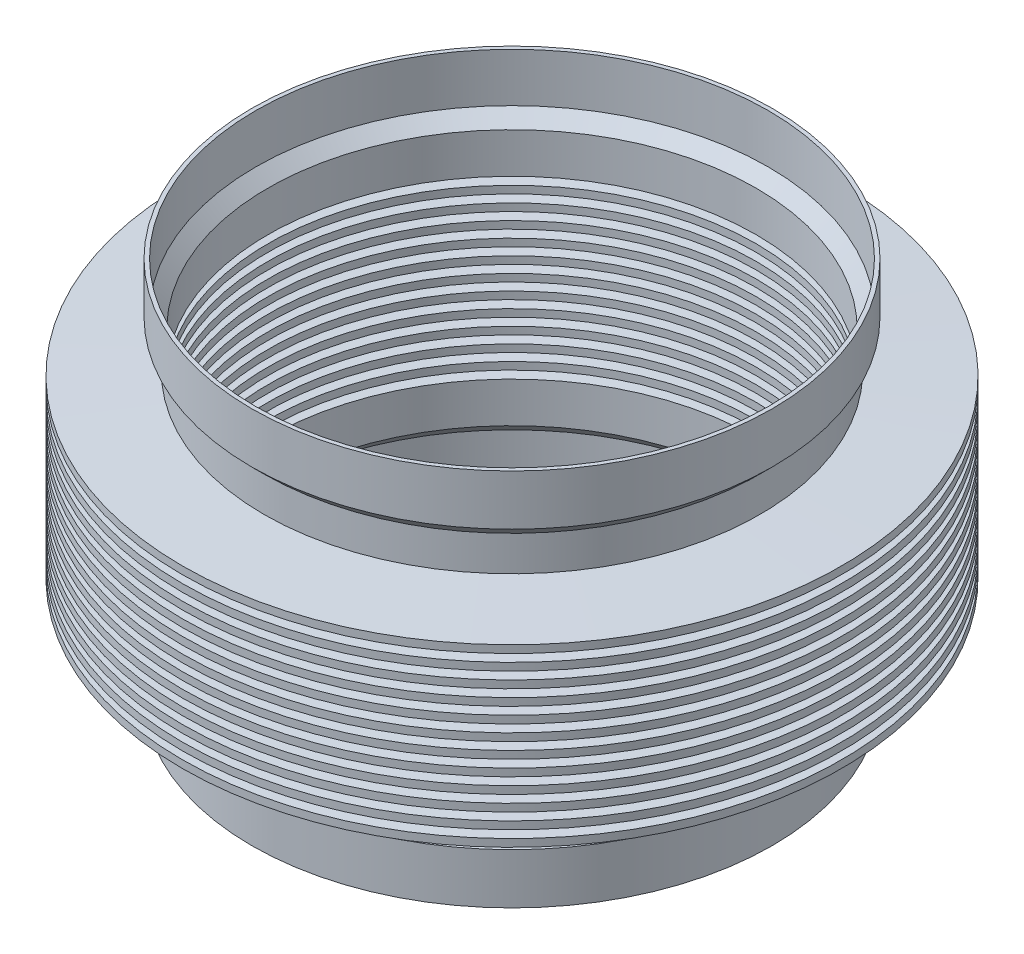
ISO-10303-21;
HEADER;
FILE_DESCRIPTION(('STEP AP214'),'2;1');
FILE_NAME('part.step','',(''),(''),'','','');
FILE_SCHEMA(('AUTOMOTIVE_DESIGN { 1 0 10303 214 1 1 1 1 }'));
ENDSEC;
DATA;
#1=APPLICATION_CONTEXT('core data for automotive mechanical design processes');
#2=APPLICATION_PROTOCOL_DEFINITION('international standard','automotive_design',2000,#1);
#3=PRODUCT_CONTEXT('',#1,'mechanical');
#4=PRODUCT('Part','Part','',(#3));
#5=PRODUCT_RELATED_PRODUCT_CATEGORY('part','',(#4));
#6=PRODUCT_DEFINITION_FORMATION('','',#4);
#7=PRODUCT_DEFINITION_CONTEXT('part definition',#1,'design');
#8=PRODUCT_DEFINITION('design','',#6,#7);
#9=PRODUCT_DEFINITION_SHAPE('','',#8);
#10=(LENGTH_UNIT() NAMED_UNIT(*) SI_UNIT(.MILLI.,.METRE.));
#11=(NAMED_UNIT(*) PLANE_ANGLE_UNIT() SI_UNIT($,.RADIAN.));
#12=(NAMED_UNIT(*) SI_UNIT($,.STERADIAN.) SOLID_ANGLE_UNIT());
#13=UNCERTAINTY_MEASURE_WITH_UNIT(LENGTH_MEASURE(1.E-05),#10,'distance_accuracy_value','');
#14=(GEOMETRIC_REPRESENTATION_CONTEXT(3) GLOBAL_UNCERTAINTY_ASSIGNED_CONTEXT((#13)) GLOBAL_UNIT_ASSIGNED_CONTEXT((#10,
#11,#12)) REPRESENTATION_CONTEXT('',''));
#15=CARTESIAN_POINT('',(0.,0.,0.));
#16=DIRECTION('',(0.,0.,1.));
#17=DIRECTION('',(1.,0.,0.));
#18=AXIS2_PLACEMENT_3D('',#15,#16,#17);
#19=CARTESIAN_POINT('',(0.,55.165625,0.));
#20=DIRECTION('',(0.,-1.,0.));
#21=DIRECTION('',(0.,0.,-1.));
#22=AXIS2_PLACEMENT_3D('',#19,#20,#21);
#23=CONICAL_SURFACE('',#22,85.159641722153,1.52397544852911);
#24=CARTESIAN_POINT('',(0.,56.1804901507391,0.));
#25=DIRECTION('',(0.,-1.,0.));
#26=DIRECTION('',(0.,0.,-1.));
#27=AXIS2_PLACEMENT_3D('',#24,#25,#26);
#28=CIRCLE('',#27,63.5);
#29=CARTESIAN_POINT('',(0.,56.1804901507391,-63.5));
#30=VERTEX_POINT('',#29);
#31=EDGE_CURVE('E382',#30,#30,#28,.T.);
#32=ORIENTED_EDGE('',*,*,#31,.F.);
#33=EDGE_LOOP('',(#32));
#34=FACE_BOUND('',#33,.T.);
#35=CARTESIAN_POINT('',(0.,55.165625,0.));
#36=DIRECTION('',(0.,-1.,0.));
#37=DIRECTION('',(0.,0.,-1.));
#38=AXIS2_PLACEMENT_3D('',#35,#36,#37);
#39=CIRCLE('',#38,85.159641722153);
#40=CARTESIAN_POINT('',(0.,55.165625,-85.159641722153));
#41=VERTEX_POINT('',#40);
#42=EDGE_CURVE('E10',#41,#41,#39,.T.);
#43=ORIENTED_EDGE('',*,*,#42,.T.);
#44=EDGE_LOOP('',(#43));
#45=FACE_BOUND('',#44,.T.);
#46=ADVANCED_FACE('F38',(#34,#45),#23,.F.);
#47=CARTESIAN_POINT('',(0.,54.1507598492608,0.));
#48=DIRECTION('',(0.,1.,0.));
#49=DIRECTION('',(0.,0.,1.));
#50=AXIS2_PLACEMENT_3D('',#47,#48,#49);
#51=CONICAL_SURFACE('',#50,63.5,1.52397544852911);
#52=ORIENTED_EDGE('',*,*,#42,.F.);
#53=EDGE_LOOP('',(#52));
#54=FACE_BOUND('',#53,.T.);
#55=CARTESIAN_POINT('',(0.,54.1507598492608,0.));
#56=DIRECTION('',(0.,-1.,0.));
#57=DIRECTION('',(0.,0.,-1.));
#58=AXIS2_PLACEMENT_3D('',#55,#56,#57);
#59=CIRCLE('',#58,63.5);
#60=CARTESIAN_POINT('',(0.,54.1507598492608,-63.5));
#61=VERTEX_POINT('',#60);
#62=EDGE_CURVE('E45',#61,#61,#59,.T.);
#63=ORIENTED_EDGE('',*,*,#62,.T.);
#64=EDGE_LOOP('',(#63));
#65=FACE_BOUND('',#64,.T.);
#66=ADVANCED_FACE('F389',(#54,#65),#51,.F.);
#67=CARTESIAN_POINT('',(0.,0.,0.));
#68=DIRECTION('',(0.,-1.,0.));
#69=DIRECTION('',(0.,0.,-1.));
#70=AXIS2_PLACEMENT_3D('',#67,#68,#69);
#71=CYLINDRICAL_SURFACE('',#70,63.5);
#72=ORIENTED_EDGE('',*,*,#62,.F.);
#73=EDGE_LOOP('',(#72));
#74=FACE_BOUND('',#73,.T.);
#75=CARTESIAN_POINT('',(0.,52.2117401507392,0.));
#76=DIRECTION('',(0.,-1.,0.));
#77=DIRECTION('',(0.,0.,-1.));
#78=AXIS2_PLACEMENT_3D('',#75,#76,#77);
#79=CIRCLE('',#78,63.5);
#80=CARTESIAN_POINT('',(0.,52.2117401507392,-63.5));
#81=VERTEX_POINT('',#80);
#82=EDGE_CURVE('E52',#81,#81,#79,.T.);
#83=ORIENTED_EDGE('',*,*,#82,.T.);
#84=EDGE_LOOP('',(#83));
#85=FACE_BOUND('',#84,.T.);
#86=ADVANCED_FACE('F393',(#74,#85),#71,.F.);
#87=CARTESIAN_POINT('',(0.,51.196875,0.));
#88=DIRECTION('',(0.,-1.,0.));
#89=DIRECTION('',(0.,0.,-1.));
#90=AXIS2_PLACEMENT_3D('',#87,#88,#89);
#91=CONICAL_SURFACE('',#90,85.159641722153,1.52397544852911);
#92=ORIENTED_EDGE('',*,*,#82,.F.);
#93=EDGE_LOOP('',(#92));
#94=FACE_BOUND('',#93,.T.);
#95=CARTESIAN_POINT('',(0.,51.196875,0.));
#96=DIRECTION('',(0.,-1.,0.));
#97=DIRECTION('',(0.,0.,-1.));
#98=AXIS2_PLACEMENT_3D('',#95,#96,#97);
#99=CIRCLE('',#98,85.159641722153);
#100=CARTESIAN_POINT('',(0.,51.196875,-85.159641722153));
#101=VERTEX_POINT('',#100);
#102=EDGE_CURVE('E58',#101,#101,#99,.T.);
#103=ORIENTED_EDGE('',*,*,#102,.T.);
#104=EDGE_LOOP('',(#103));
#105=FACE_BOUND('',#104,.T.);
#106=ADVANCED_FACE('F398',(#94,#105),#91,.F.);
#107=CARTESIAN_POINT('',(0.,50.1820098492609,0.));
#108=DIRECTION('',(0.,1.,0.));
#109=DIRECTION('',(0.,0.,1.));
#110=AXIS2_PLACEMENT_3D('',#107,#108,#109);
#111=CONICAL_SURFACE('',#110,63.5,1.52397544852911);
#112=ORIENTED_EDGE('',*,*,#102,.F.);
#113=EDGE_LOOP('',(#112));
#114=FACE_BOUND('',#113,.T.);
#115=CARTESIAN_POINT('',(0.,50.1820098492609,0.));
#116=DIRECTION('',(0.,-1.,0.));
#117=DIRECTION('',(0.,0.,-1.));
#118=AXIS2_PLACEMENT_3D('',#115,#116,#117);
#119=CIRCLE('',#118,63.5);
#120=CARTESIAN_POINT('',(0.,50.1820098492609,-63.5));
#121=VERTEX_POINT('',#120);
#122=EDGE_CURVE('E64',#121,#121,#119,.T.);
#123=ORIENTED_EDGE('',*,*,#122,.T.);
#124=EDGE_LOOP('',(#123));
#125=FACE_BOUND('',#124,.T.);
#126=ADVANCED_FACE('F404',(#114,#125),#111,.F.);
#127=CARTESIAN_POINT('',(0.,0.,0.));
#128=DIRECTION('',(0.,-1.,0.));
#129=DIRECTION('',(0.,0.,-1.));
#130=AXIS2_PLACEMENT_3D('',#127,#128,#129);
#131=CYLINDRICAL_SURFACE('',#130,63.5);
#132=ORIENTED_EDGE('',*,*,#122,.F.);
#133=EDGE_LOOP('',(#132));
#134=FACE_BOUND('',#133,.T.);
#135=CARTESIAN_POINT('',(0.,48.2429901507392,0.));
#136=DIRECTION('',(0.,-1.,0.));
#137=DIRECTION('',(0.,0.,-1.));
#138=AXIS2_PLACEMENT_3D('',#135,#136,#137);
#139=CIRCLE('',#138,63.5);
#140=CARTESIAN_POINT('',(0.,48.2429901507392,-63.5));
#141=VERTEX_POINT('',#140);
#142=EDGE_CURVE('E68',#141,#141,#139,.T.);
#143=ORIENTED_EDGE('',*,*,#142,.T.);
#144=EDGE_LOOP('',(#143));
#145=FACE_BOUND('',#144,.T.);
#146=ADVANCED_FACE('F408',(#134,#145),#131,.F.);
#147=CARTESIAN_POINT('',(0.,47.228125,0.));
#148=DIRECTION('',(0.,-1.,0.));
#149=DIRECTION('',(0.,0.,-1.));
#150=AXIS2_PLACEMENT_3D('',#147,#148,#149);
#151=CONICAL_SURFACE('',#150,85.159641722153,1.52397544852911);
#152=ORIENTED_EDGE('',*,*,#142,.F.);
#153=EDGE_LOOP('',(#152));
#154=FACE_BOUND('',#153,.T.);
#155=CARTESIAN_POINT('',(0.,47.228125,0.));
#156=DIRECTION('',(0.,-1.,0.));
#157=DIRECTION('',(0.,0.,-1.));
#158=AXIS2_PLACEMENT_3D('',#155,#156,#157);
#159=CIRCLE('',#158,85.159641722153);
#160=CARTESIAN_POINT('',(0.,47.228125,-85.159641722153));
#161=VERTEX_POINT('',#160);
#162=EDGE_CURVE('E72',#161,#161,#159,.T.);
#163=ORIENTED_EDGE('',*,*,#162,.T.);
#164=EDGE_LOOP('',(#163));
#165=FACE_BOUND('',#164,.T.);
#166=ADVANCED_FACE('F412',(#154,#165),#151,.F.);
#167=CARTESIAN_POINT('',(0.,46.2132598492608,0.));
#168=DIRECTION('',(0.,1.,0.));
#169=DIRECTION('',(0.,0.,1.));
#170=AXIS2_PLACEMENT_3D('',#167,#168,#169);
#171=CONICAL_SURFACE('',#170,63.5,1.52397544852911);
#172=ORIENTED_EDGE('',*,*,#162,.F.);
#173=EDGE_LOOP('',(#172));
#174=FACE_BOUND('',#173,.T.);
#175=CARTESIAN_POINT('',(0.,46.2132598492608,0.));
#176=DIRECTION('',(0.,-1.,0.));
#177=DIRECTION('',(0.,0.,-1.));
#178=AXIS2_PLACEMENT_3D('',#175,#176,#177);
#179=CIRCLE('',#178,63.5);
#180=CARTESIAN_POINT('',(0.,46.2132598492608,-63.5));
#181=VERTEX_POINT('',#180);
#182=EDGE_CURVE('E76',#181,#181,#179,.T.);
#183=ORIENTED_EDGE('',*,*,#182,.T.);
#184=EDGE_LOOP('',(#183));
#185=FACE_BOUND('',#184,.T.);
#186=ADVANCED_FACE('F416',(#174,#185),#171,.F.);
#187=CARTESIAN_POINT('',(0.,0.,0.));
#188=DIRECTION('',(0.,-1.,0.));
#189=DIRECTION('',(0.,0.,-1.));
#190=AXIS2_PLACEMENT_3D('',#187,#188,#189);
#191=CYLINDRICAL_SURFACE('',#190,63.5);
#192=ORIENTED_EDGE('',*,*,#182,.F.);
#193=EDGE_LOOP('',(#192));
#194=FACE_BOUND('',#193,.T.);
#195=CARTESIAN_POINT('',(0.,44.2742401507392,0.));
#196=DIRECTION('',(0.,-1.,0.));
#197=DIRECTION('',(0.,0.,-1.));
#198=AXIS2_PLACEMENT_3D('',#195,#196,#197);
#199=CIRCLE('',#198,63.5);
#200=CARTESIAN_POINT('',(0.,44.2742401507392,-63.5));
#201=VERTEX_POINT('',#200);
#202=EDGE_CURVE('E80',#201,#201,#199,.T.);
#203=ORIENTED_EDGE('',*,*,#202,.T.);
#204=EDGE_LOOP('',(#203));
#205=FACE_BOUND('',#204,.T.);
#206=ADVANCED_FACE('F420',(#194,#205),#191,.F.);
#207=CARTESIAN_POINT('',(0.,43.259375,0.));
#208=DIRECTION('',(0.,-1.,0.));
#209=DIRECTION('',(0.,0.,-1.));
#210=AXIS2_PLACEMENT_3D('',#207,#208,#209);
#211=CONICAL_SURFACE('',#210,85.159641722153,1.52397544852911);
#212=ORIENTED_EDGE('',*,*,#202,.F.);
#213=EDGE_LOOP('',(#212));
#214=FACE_BOUND('',#213,.T.);
#215=CARTESIAN_POINT('',(0.,43.259375,0.));
#216=DIRECTION('',(0.,-1.,0.));
#217=DIRECTION('',(0.,0.,-1.));
#218=AXIS2_PLACEMENT_3D('',#215,#216,#217);
#219=CIRCLE('',#218,85.159641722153);
#220=CARTESIAN_POINT('',(0.,43.259375,-85.159641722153));
#221=VERTEX_POINT('',#220);
#222=EDGE_CURVE('E84',#221,#221,#219,.T.);
#223=ORIENTED_EDGE('',*,*,#222,.T.);
#224=EDGE_LOOP('',(#223));
#225=FACE_BOUND('',#224,.T.);
#226=ADVANCED_FACE('F424',(#214,#225),#211,.F.);
#227=CARTESIAN_POINT('',(0.,42.2445098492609,0.));
#228=DIRECTION('',(0.,1.,0.));
#229=DIRECTION('',(0.,0.,1.));
#230=AXIS2_PLACEMENT_3D('',#227,#228,#229);
#231=CONICAL_SURFACE('',#230,63.5,1.52397544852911);
#232=ORIENTED_EDGE('',*,*,#222,.F.);
#233=EDGE_LOOP('',(#232));
#234=FACE_BOUND('',#233,.T.);
#235=CARTESIAN_POINT('',(0.,42.2445098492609,0.));
#236=DIRECTION('',(0.,-1.,0.));
#237=DIRECTION('',(0.,0.,-1.));
#238=AXIS2_PLACEMENT_3D('',#235,#236,#237);
#239=CIRCLE('',#238,63.5);
#240=CARTESIAN_POINT('',(0.,42.2445098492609,-63.5));
#241=VERTEX_POINT('',#240);
#242=EDGE_CURVE('E88',#241,#241,#239,.T.);
#243=ORIENTED_EDGE('',*,*,#242,.T.);
#244=EDGE_LOOP('',(#243));
#245=FACE_BOUND('',#244,.T.);
#246=ADVANCED_FACE('F428',(#234,#245),#231,.F.);
#247=CARTESIAN_POINT('',(0.,0.,0.));
#248=DIRECTION('',(0.,-1.,0.));
#249=DIRECTION('',(0.,0.,-1.));
#250=AXIS2_PLACEMENT_3D('',#247,#248,#249);
#251=CYLINDRICAL_SURFACE('',#250,63.5);
#252=ORIENTED_EDGE('',*,*,#242,.F.);
#253=EDGE_LOOP('',(#252));
#254=FACE_BOUND('',#253,.T.);
#255=CARTESIAN_POINT('',(0.,40.3054901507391,0.));
#256=DIRECTION('',(0.,-1.,0.));
#257=DIRECTION('',(0.,0.,-1.));
#258=AXIS2_PLACEMENT_3D('',#255,#256,#257);
#259=CIRCLE('',#258,63.5);
#260=CARTESIAN_POINT('',(0.,40.3054901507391,-63.5));
#261=VERTEX_POINT('',#260);
#262=EDGE_CURVE('E92',#261,#261,#259,.T.);
#263=ORIENTED_EDGE('',*,*,#262,.T.);
#264=EDGE_LOOP('',(#263));
#265=FACE_BOUND('',#264,.T.);
#266=ADVANCED_FACE('F432',(#254,#265),#251,.F.);
#267=CARTESIAN_POINT('',(0.,39.290625,0.));
#268=DIRECTION('',(0.,-1.,0.));
#269=DIRECTION('',(0.,0.,-1.));
#270=AXIS2_PLACEMENT_3D('',#267,#268,#269);
#271=CONICAL_SURFACE('',#270,85.159641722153,1.52397544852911);
#272=ORIENTED_EDGE('',*,*,#262,.F.);
#273=EDGE_LOOP('',(#272));
#274=FACE_BOUND('',#273,.T.);
#275=CARTESIAN_POINT('',(0.,39.290625,0.));
#276=DIRECTION('',(0.,-1.,0.));
#277=DIRECTION('',(0.,0.,-1.));
#278=AXIS2_PLACEMENT_3D('',#275,#276,#277);
#279=CIRCLE('',#278,85.159641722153);
#280=CARTESIAN_POINT('',(0.,39.290625,-85.159641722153));
#281=VERTEX_POINT('',#280);
#282=EDGE_CURVE('E96',#281,#281,#279,.T.);
#283=ORIENTED_EDGE('',*,*,#282,.T.);
#284=EDGE_LOOP('',(#283));
#285=FACE_BOUND('',#284,.T.);
#286=ADVANCED_FACE('F436',(#274,#285),#271,.F.);
#287=CARTESIAN_POINT('',(0.,38.2757598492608,0.));
#288=DIRECTION('',(0.,1.,0.));
#289=DIRECTION('',(0.,0.,1.));
#290=AXIS2_PLACEMENT_3D('',#287,#288,#289);
#291=CONICAL_SURFACE('',#290,63.5,1.52397544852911);
#292=ORIENTED_EDGE('',*,*,#282,.F.);
#293=EDGE_LOOP('',(#292));
#294=FACE_BOUND('',#293,.T.);
#295=CARTESIAN_POINT('',(0.,38.2757598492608,0.));
#296=DIRECTION('',(0.,-1.,0.));
#297=DIRECTION('',(0.,0.,-1.));
#298=AXIS2_PLACEMENT_3D('',#295,#296,#297);
#299=CIRCLE('',#298,63.5);
#300=CARTESIAN_POINT('',(0.,38.2757598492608,-63.5));
#301=VERTEX_POINT('',#300);
#302=EDGE_CURVE('E100',#301,#301,#299,.T.);
#303=ORIENTED_EDGE('',*,*,#302,.T.);
#304=EDGE_LOOP('',(#303));
#305=FACE_BOUND('',#304,.T.);
#306=ADVANCED_FACE('F440',(#294,#305),#291,.F.);
#307=CARTESIAN_POINT('',(0.,0.,0.));
#308=DIRECTION('',(0.,-1.,0.));
#309=DIRECTION('',(0.,0.,-1.));
#310=AXIS2_PLACEMENT_3D('',#307,#308,#309);
#311=CYLINDRICAL_SURFACE('',#310,63.5);
#312=ORIENTED_EDGE('',*,*,#302,.F.);
#313=EDGE_LOOP('',(#312));
#314=FACE_BOUND('',#313,.T.);
#315=CARTESIAN_POINT('',(0.,36.3367401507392,0.));
#316=DIRECTION('',(0.,-1.,0.));
#317=DIRECTION('',(0.,0.,-1.));
#318=AXIS2_PLACEMENT_3D('',#315,#316,#317);
#319=CIRCLE('',#318,63.5);
#320=CARTESIAN_POINT('',(0.,36.3367401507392,-63.5));
#321=VERTEX_POINT('',#320);
#322=EDGE_CURVE('E104',#321,#321,#319,.T.);
#323=ORIENTED_EDGE('',*,*,#322,.T.);
#324=EDGE_LOOP('',(#323));
#325=FACE_BOUND('',#324,.T.);
#326=ADVANCED_FACE('F444',(#314,#325),#311,.F.);
#327=CARTESIAN_POINT('',(0.,35.321875,0.));
#328=DIRECTION('',(0.,-1.,0.));
#329=DIRECTION('',(0.,0.,-1.));
#330=AXIS2_PLACEMENT_3D('',#327,#328,#329);
#331=CONICAL_SURFACE('',#330,85.159641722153,1.52397544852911);
#332=ORIENTED_EDGE('',*,*,#322,.F.);
#333=EDGE_LOOP('',(#332));
#334=FACE_BOUND('',#333,.T.);
#335=CARTESIAN_POINT('',(0.,35.321875,0.));
#336=DIRECTION('',(0.,-1.,0.));
#337=DIRECTION('',(0.,0.,-1.));
#338=AXIS2_PLACEMENT_3D('',#335,#336,#337);
#339=CIRCLE('',#338,85.159641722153);
#340=CARTESIAN_POINT('',(0.,35.321875,-85.159641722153));
#341=VERTEX_POINT('',#340);
#342=EDGE_CURVE('E108',#341,#341,#339,.T.);
#343=ORIENTED_EDGE('',*,*,#342,.T.);
#344=EDGE_LOOP('',(#343));
#345=FACE_BOUND('',#344,.T.);
#346=ADVANCED_FACE('F448',(#334,#345),#331,.F.);
#347=CARTESIAN_POINT('',(0.,34.3070098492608,0.));
#348=DIRECTION('',(0.,1.,0.));
#349=DIRECTION('',(0.,0.,1.));
#350=AXIS2_PLACEMENT_3D('',#347,#348,#349);
#351=CONICAL_SURFACE('',#350,63.5,1.52397544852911);
#352=ORIENTED_EDGE('',*,*,#342,.F.);
#353=EDGE_LOOP('',(#352));
#354=FACE_BOUND('',#353,.T.);
#355=CARTESIAN_POINT('',(0.,34.3070098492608,0.));
#356=DIRECTION('',(0.,-1.,0.));
#357=DIRECTION('',(0.,0.,-1.));
#358=AXIS2_PLACEMENT_3D('',#355,#356,#357);
#359=CIRCLE('',#358,63.5);
#360=CARTESIAN_POINT('',(0.,34.3070098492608,-63.5));
#361=VERTEX_POINT('',#360);
#362=EDGE_CURVE('E112',#361,#361,#359,.T.);
#363=ORIENTED_EDGE('',*,*,#362,.T.);
#364=EDGE_LOOP('',(#363));
#365=FACE_BOUND('',#364,.T.);
#366=ADVANCED_FACE('F452',(#354,#365),#351,.F.);
#367=CARTESIAN_POINT('',(0.,0.,0.));
#368=DIRECTION('',(0.,-1.,0.));
#369=DIRECTION('',(0.,0.,-1.));
#370=AXIS2_PLACEMENT_3D('',#367,#368,#369);
#371=CYLINDRICAL_SURFACE('',#370,63.5);
#372=ORIENTED_EDGE('',*,*,#362,.F.);
#373=EDGE_LOOP('',(#372));
#374=FACE_BOUND('',#373,.T.);
#375=CARTESIAN_POINT('',(0.,32.3679901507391,0.));
#376=DIRECTION('',(0.,-1.,0.));
#377=DIRECTION('',(0.,0.,-1.));
#378=AXIS2_PLACEMENT_3D('',#375,#376,#377);
#379=CIRCLE('',#378,63.5);
#380=CARTESIAN_POINT('',(0.,32.3679901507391,-63.5));
#381=VERTEX_POINT('',#380);
#382=EDGE_CURVE('E116',#381,#381,#379,.T.);
#383=ORIENTED_EDGE('',*,*,#382,.T.);
#384=EDGE_LOOP('',(#383));
#385=FACE_BOUND('',#384,.T.);
#386=ADVANCED_FACE('F456',(#374,#385),#371,.F.);
#387=CARTESIAN_POINT('',(0.,31.353125,0.));
#388=DIRECTION('',(0.,-1.,0.));
#389=DIRECTION('',(0.,0.,-1.));
#390=AXIS2_PLACEMENT_3D('',#387,#388,#389);
#391=CONICAL_SURFACE('',#390,85.159641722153,1.52397544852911);
#392=ORIENTED_EDGE('',*,*,#382,.F.);
#393=EDGE_LOOP('',(#392));
#394=FACE_BOUND('',#393,.T.);
#395=CARTESIAN_POINT('',(0.,31.353125,0.));
#396=DIRECTION('',(0.,-1.,0.));
#397=DIRECTION('',(0.,0.,-1.));
#398=AXIS2_PLACEMENT_3D('',#395,#396,#397);
#399=CIRCLE('',#398,85.159641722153);
#400=CARTESIAN_POINT('',(0.,31.353125,-85.159641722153));
#401=VERTEX_POINT('',#400);
#402=EDGE_CURVE('E120',#401,#401,#399,.T.);
#403=ORIENTED_EDGE('',*,*,#402,.T.);
#404=EDGE_LOOP('',(#403));
#405=FACE_BOUND('',#404,.T.);
#406=ADVANCED_FACE('F460',(#394,#405),#391,.F.);
#407=CARTESIAN_POINT('',(0.,30.3382598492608,0.));
#408=DIRECTION('',(0.,1.,0.));
#409=DIRECTION('',(0.,0.,1.));
#410=AXIS2_PLACEMENT_3D('',#407,#408,#409);
#411=CONICAL_SURFACE('',#410,63.5,1.52397544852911);
#412=ORIENTED_EDGE('',*,*,#402,.F.);
#413=EDGE_LOOP('',(#412));
#414=FACE_BOUND('',#413,.T.);
#415=CARTESIAN_POINT('',(0.,30.3382598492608,0.));
#416=DIRECTION('',(0.,-1.,0.));
#417=DIRECTION('',(0.,0.,-1.));
#418=AXIS2_PLACEMENT_3D('',#415,#416,#417);
#419=CIRCLE('',#418,63.5);
#420=CARTESIAN_POINT('',(0.,30.3382598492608,-63.5));
#421=VERTEX_POINT('',#420);
#422=EDGE_CURVE('E124',#421,#421,#419,.T.);
#423=ORIENTED_EDGE('',*,*,#422,.T.);
#424=EDGE_LOOP('',(#423));
#425=FACE_BOUND('',#424,.T.);
#426=ADVANCED_FACE('F464',(#414,#425),#411,.F.);
#427=CARTESIAN_POINT('',(0.,0.,0.));
#428=DIRECTION('',(0.,-1.,0.));
#429=DIRECTION('',(0.,0.,-1.));
#430=AXIS2_PLACEMENT_3D('',#427,#428,#429);
#431=CYLINDRICAL_SURFACE('',#430,63.5);
#432=ORIENTED_EDGE('',*,*,#422,.F.);
#433=EDGE_LOOP('',(#432));
#434=FACE_BOUND('',#433,.T.);
#435=CARTESIAN_POINT('',(0.,28.3992401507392,0.));
#436=DIRECTION('',(0.,-1.,0.));
#437=DIRECTION('',(0.,0.,-1.));
#438=AXIS2_PLACEMENT_3D('',#435,#436,#437);
#439=CIRCLE('',#438,63.5);
#440=CARTESIAN_POINT('',(0.,28.3992401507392,-63.5));
#441=VERTEX_POINT('',#440);
#442=EDGE_CURVE('E128',#441,#441,#439,.T.);
#443=ORIENTED_EDGE('',*,*,#442,.T.);
#444=EDGE_LOOP('',(#443));
#445=FACE_BOUND('',#444,.T.);
#446=ADVANCED_FACE('F468',(#434,#445),#431,.F.);
#447=CARTESIAN_POINT('',(0.,27.384375,0.));
#448=DIRECTION('',(0.,-1.,0.));
#449=DIRECTION('',(0.,0.,-1.));
#450=AXIS2_PLACEMENT_3D('',#447,#448,#449);
#451=CONICAL_SURFACE('',#450,85.159641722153,1.52397544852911);
#452=ORIENTED_EDGE('',*,*,#442,.F.);
#453=EDGE_LOOP('',(#452));
#454=FACE_BOUND('',#453,.T.);
#455=CARTESIAN_POINT('',(0.,27.384375,0.));
#456=DIRECTION('',(0.,-1.,0.));
#457=DIRECTION('',(0.,0.,-1.));
#458=AXIS2_PLACEMENT_3D('',#455,#456,#457);
#459=CIRCLE('',#458,85.159641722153);
#460=CARTESIAN_POINT('',(0.,27.384375,-85.159641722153));
#461=VERTEX_POINT('',#460);
#462=EDGE_CURVE('E132',#461,#461,#459,.T.);
#463=ORIENTED_EDGE('',*,*,#462,.T.);
#464=EDGE_LOOP('',(#463));
#465=FACE_BOUND('',#464,.T.);
#466=ADVANCED_FACE('F472',(#454,#465),#451,.F.);
#467=CARTESIAN_POINT('',(0.,26.3695098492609,0.));
#468=DIRECTION('',(0.,1.,0.));
#469=DIRECTION('',(0.,0.,1.));
#470=AXIS2_PLACEMENT_3D('',#467,#468,#469);
#471=CONICAL_SURFACE('',#470,63.5,1.52397544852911);
#472=ORIENTED_EDGE('',*,*,#462,.F.);
#473=EDGE_LOOP('',(#472));
#474=FACE_BOUND('',#473,.T.);
#475=CARTESIAN_POINT('',(0.,26.3695098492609,0.));
#476=DIRECTION('',(0.,-1.,0.));
#477=DIRECTION('',(0.,0.,-1.));
#478=AXIS2_PLACEMENT_3D('',#475,#476,#477);
#479=CIRCLE('',#478,63.5);
#480=CARTESIAN_POINT('',(0.,26.3695098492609,-63.5));
#481=VERTEX_POINT('',#480);
#482=EDGE_CURVE('E136',#481,#481,#479,.T.);
#483=ORIENTED_EDGE('',*,*,#482,.T.);
#484=EDGE_LOOP('',(#483));
#485=FACE_BOUND('',#484,.T.);
#486=ADVANCED_FACE('F476',(#474,#485),#471,.F.);
#487=CARTESIAN_POINT('',(0.,0.,0.));
#488=DIRECTION('',(0.,-1.,0.));
#489=DIRECTION('',(0.,0.,-1.));
#490=AXIS2_PLACEMENT_3D('',#487,#488,#489);
#491=CYLINDRICAL_SURFACE('',#490,63.5);
#492=ORIENTED_EDGE('',*,*,#482,.F.);
#493=EDGE_LOOP('',(#492));
#494=FACE_BOUND('',#493,.T.);
#495=CARTESIAN_POINT('',(0.,15.875,0.));
#496=DIRECTION('',(0.,-1.,0.));
#497=DIRECTION('',(0.,0.,-1.));
#498=AXIS2_PLACEMENT_3D('',#495,#496,#497);
#499=CIRCLE('',#498,63.5);
#500=CARTESIAN_POINT('',(0.,15.875,-63.5));
#501=VERTEX_POINT('',#500);
#502=EDGE_CURVE('E139',#501,#501,#499,.T.);
#503=ORIENTED_EDGE('',*,*,#502,.T.);
#504=EDGE_LOOP('',(#503));
#505=FACE_BOUND('',#504,.T.);
#506=ADVANCED_FACE('F480',(#494,#505),#491,.F.);
#507=CARTESIAN_POINT('',(0.,12.7,0.));
#508=DIRECTION('',(0.,-1.,0.));
#509=DIRECTION('',(0.,0.,-1.));
#510=AXIS2_PLACEMENT_3D('',#507,#508,#509);
#511=CONICAL_SURFACE('',#510,66.675,0.78539816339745);
#512=ORIENTED_EDGE('',*,*,#502,.F.);
#513=EDGE_LOOP('',(#512));
#514=FACE_BOUND('',#513,.T.);
#515=CARTESIAN_POINT('',(0.,12.7,0.));
#516=DIRECTION('',(0.,-1.,0.));
#517=DIRECTION('',(0.,0.,-1.));
#518=AXIS2_PLACEMENT_3D('',#515,#516,#517);
#519=CIRCLE('',#518,66.675);
#520=CARTESIAN_POINT('',(0.,12.7,-66.675));
#521=VERTEX_POINT('',#520);
#522=EDGE_CURVE('E143',#521,#521,#519,.T.);
#523=ORIENTED_EDGE('',*,*,#522,.T.);
#524=EDGE_LOOP('',(#523));
#525=FACE_BOUND('',#524,.T.);
#526=ADVANCED_FACE('F484',(#514,#525),#511,.F.);
#527=CARTESIAN_POINT('',(0.,0.,0.));
#528=DIRECTION('',(0.,-1.,0.));
#529=DIRECTION('',(0.,0.,-1.));
#530=AXIS2_PLACEMENT_3D('',#527,#528,#529);
#531=CYLINDRICAL_SURFACE('',#530,66.675);
#532=ORIENTED_EDGE('',*,*,#522,.F.);
#533=EDGE_LOOP('',(#532));
#534=FACE_BOUND('',#533,.T.);
#535=CARTESIAN_POINT('',(0.,0.,0.));
#536=DIRECTION('',(0.,-1.,0.));
#537=DIRECTION('',(0.,0.,-1.));
#538=AXIS2_PLACEMENT_3D('',#535,#536,#537);
#539=CIRCLE('',#538,66.675);
#540=CARTESIAN_POINT('',(0.,0.,-66.675));
#541=VERTEX_POINT('',#540);
#542=EDGE_CURVE('E147',#541,#541,#539,.T.);
#543=ORIENTED_EDGE('',*,*,#542,.T.);
#544=EDGE_LOOP('',(#543));
#545=FACE_BOUND('',#544,.T.);
#546=ADVANCED_FACE('F488',(#534,#545),#531,.F.);
#547=CARTESIAN_POINT('',(-67.691,0.,0.));
#548=DIRECTION('',(0.,1.,0.));
#549=DIRECTION('',(0.,0.,1.));
#550=AXIS2_PLACEMENT_3D('',#547,#548,#549);
#551=PLANE('',#550);
#552=ORIENTED_EDGE('',*,*,#542,.F.);
#553=EDGE_LOOP('',(#552));
#554=FACE_BOUND('',#553,.T.);
#555=CARTESIAN_POINT('',(0.,0.,0.));
#556=DIRECTION('',(0.,-1.,0.));
#557=DIRECTION('',(0.,0.,-1.));
#558=AXIS2_PLACEMENT_3D('',#555,#556,#557);
#559=CIRCLE('',#558,67.691);
#560=CARTESIAN_POINT('',(0.,0.,-67.691));
#561=VERTEX_POINT('',#560);
#562=EDGE_CURVE('E151',#561,#561,#559,.T.);
#563=ORIENTED_EDGE('',*,*,#562,.T.);
#564=EDGE_LOOP('',(#563));
#565=FACE_BOUND('',#564,.T.);
#566=ADVANCED_FACE('F492',(#554,#565),#551,.F.);
#567=CARTESIAN_POINT('',(0.,0.,0.));
#568=DIRECTION('',(0.,-1.,0.));
#569=DIRECTION('',(0.,0.,-1.));
#570=AXIS2_PLACEMENT_3D('',#567,#568,#569);
#571=CYLINDRICAL_SURFACE('',#570,67.691);
#572=ORIENTED_EDGE('',*,*,#562,.F.);
#573=EDGE_LOOP('',(#572));
#574=FACE_BOUND('',#573,.T.);
#575=CARTESIAN_POINT('',(0.,13.1208409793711,0.));
#576=DIRECTION('',(0.,-1.,0.));
#577=DIRECTION('',(0.,0.,-1.));
#578=AXIS2_PLACEMENT_3D('',#575,#576,#577);
#579=CIRCLE('',#578,67.691);
#580=CARTESIAN_POINT('',(0.,13.1208409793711,-67.691));
#581=VERTEX_POINT('',#580);
#582=EDGE_CURVE('E155',#581,#581,#579,.T.);
#583=ORIENTED_EDGE('',*,*,#582,.T.);
#584=EDGE_LOOP('',(#583));
#585=FACE_BOUND('',#584,.T.);
#586=ADVANCED_FACE('F496',(#574,#585),#571,.T.);
#587=CARTESIAN_POINT('',(0.,16.295840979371,0.));
#588=DIRECTION('',(0.,-1.,0.));
#589=DIRECTION('',(0.,0.,-1.));
#590=AXIS2_PLACEMENT_3D('',#587,#588,#589);
#591=CONICAL_SURFACE('',#590,64.516,0.78539816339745);
#592=ORIENTED_EDGE('',*,*,#582,.F.);
#593=EDGE_LOOP('',(#592));
#594=FACE_BOUND('',#593,.T.);
#595=CARTESIAN_POINT('',(0.,16.295840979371,0.));
#596=DIRECTION('',(0.,-1.,0.));
#597=DIRECTION('',(0.,0.,-1.));
#598=AXIS2_PLACEMENT_3D('',#595,#596,#597);
#599=CIRCLE('',#598,64.516);
#600=CARTESIAN_POINT('',(0.,16.295840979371,-64.516));
#601=VERTEX_POINT('',#600);
#602=EDGE_CURVE('E159',#601,#601,#599,.T.);
#603=ORIENTED_EDGE('',*,*,#602,.T.);
#604=EDGE_LOOP('',(#603));
#605=FACE_BOUND('',#604,.T.);
#606=ADVANCED_FACE('F500',(#594,#605),#591,.T.);
#607=CARTESIAN_POINT('',(0.,0.,0.));
#608=DIRECTION('',(0.,-1.,0.));
#609=DIRECTION('',(0.,0.,-1.));
#610=AXIS2_PLACEMENT_3D('',#607,#608,#609);
#611=CYLINDRICAL_SURFACE('',#610,64.516);
#612=ORIENTED_EDGE('',*,*,#602,.F.);
#613=EDGE_LOOP('',(#612));
#614=FACE_BOUND('',#613,.T.);
#615=CARTESIAN_POINT('',(0.,25.4,0.));
#616=DIRECTION('',(0.,-1.,0.));
#617=DIRECTION('',(0.,0.,-1.));
#618=AXIS2_PLACEMENT_3D('',#615,#616,#617);
#619=CIRCLE('',#618,64.516);
#620=CARTESIAN_POINT('',(0.,25.4,-64.516));
#621=VERTEX_POINT('',#620);
#622=EDGE_CURVE('E163',#621,#621,#619,.T.);
#623=ORIENTED_EDGE('',*,*,#622,.T.);
#624=EDGE_LOOP('',(#623));
#625=FACE_BOUND('',#624,.T.);
#626=ADVANCED_FACE('F504',(#614,#625),#611,.T.);
#627=CARTESIAN_POINT('',(0.,26.3937502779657,0.));
#628=DIRECTION('',(0.,1.,0.));
#629=DIRECTION('',(0.,0.,1.));
#630=AXIS2_PLACEMENT_3D('',#627,#628,#629);
#631=CONICAL_SURFACE('',#630,85.725,1.52397544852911);
#632=ORIENTED_EDGE('',*,*,#622,.F.);
#633=EDGE_LOOP('',(#632));
#634=FACE_BOUND('',#633,.T.);
#635=CARTESIAN_POINT('',(0.,26.3937502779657,0.));
#636=DIRECTION('',(0.,-1.,0.));
#637=DIRECTION('',(0.,0.,-1.));
#638=AXIS2_PLACEMENT_3D('',#635,#636,#637);
#639=CIRCLE('',#638,85.725);
#640=CARTESIAN_POINT('',(0.,26.3937502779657,-85.725));
#641=VERTEX_POINT('',#640);
#642=EDGE_CURVE('E167',#641,#641,#639,.T.);
#643=ORIENTED_EDGE('',*,*,#642,.T.);
#644=EDGE_LOOP('',(#643));
#645=FACE_BOUND('',#644,.T.);
#646=ADVANCED_FACE('F508',(#634,#645),#631,.T.);
#647=CARTESIAN_POINT('',(0.,0.,0.));
#648=DIRECTION('',(0.,-1.,0.));
#649=DIRECTION('',(0.,0.,-1.));
#650=AXIS2_PLACEMENT_3D('',#647,#648,#649);
#651=CYLINDRICAL_SURFACE('',#650,85.725);
#652=ORIENTED_EDGE('',*,*,#642,.F.);
#653=EDGE_LOOP('',(#652));
#654=FACE_BOUND('',#653,.T.);
#655=CARTESIAN_POINT('',(0.,28.3749997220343,0.));
#656=DIRECTION('',(0.,-1.,0.));
#657=DIRECTION('',(0.,0.,-1.));
#658=AXIS2_PLACEMENT_3D('',#655,#656,#657);
#659=CIRCLE('',#658,85.725);
#660=CARTESIAN_POINT('',(0.,28.3749997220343,-85.725));
#661=VERTEX_POINT('',#660);
#662=EDGE_CURVE('E171',#661,#661,#659,.T.);
#663=ORIENTED_EDGE('',*,*,#662,.T.);
#664=EDGE_LOOP('',(#663));
#665=FACE_BOUND('',#664,.T.);
#666=ADVANCED_FACE('F512',(#654,#665),#651,.T.);
#667=CARTESIAN_POINT('',(0.,29.36875,0.));
#668=DIRECTION('',(0.,-1.,0.));
#669=DIRECTION('',(0.,0.,-1.));
#670=AXIS2_PLACEMENT_3D('',#667,#668,#669);
#671=CONICAL_SURFACE('',#670,64.516,1.52397544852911);
#672=ORIENTED_EDGE('',*,*,#662,.F.);
#673=EDGE_LOOP('',(#672));
#674=FACE_BOUND('',#673,.T.);
#675=CARTESIAN_POINT('',(0.,29.36875,0.));
#676=DIRECTION('',(0.,-1.,0.));
#677=DIRECTION('',(0.,0.,-1.));
#678=AXIS2_PLACEMENT_3D('',#675,#676,#677);
#679=CIRCLE('',#678,64.516);
#680=CARTESIAN_POINT('',(0.,29.36875,-64.516));
#681=VERTEX_POINT('',#680);
#682=EDGE_CURVE('E175',#681,#681,#679,.T.);
#683=ORIENTED_EDGE('',*,*,#682,.T.);
#684=EDGE_LOOP('',(#683));
#685=FACE_BOUND('',#684,.T.);
#686=ADVANCED_FACE('F516',(#674,#685),#671,.T.);
#687=CARTESIAN_POINT('',(0.,30.3625002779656,0.));
#688=DIRECTION('',(0.,1.,0.));
#689=DIRECTION('',(0.,0.,1.));
#690=AXIS2_PLACEMENT_3D('',#687,#688,#689);
#691=CONICAL_SURFACE('',#690,85.725,1.52397544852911);
#692=ORIENTED_EDGE('',*,*,#682,.F.);
#693=EDGE_LOOP('',(#692));
#694=FACE_BOUND('',#693,.T.);
#695=CARTESIAN_POINT('',(0.,30.3625002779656,0.));
#696=DIRECTION('',(0.,-1.,0.));
#697=DIRECTION('',(0.,0.,-1.));
#698=AXIS2_PLACEMENT_3D('',#695,#696,#697);
#699=CIRCLE('',#698,85.725);
#700=CARTESIAN_POINT('',(0.,30.3625002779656,-85.725));
#701=VERTEX_POINT('',#700);
#702=EDGE_CURVE('E179',#701,#701,#699,.T.);
#703=ORIENTED_EDGE('',*,*,#702,.T.);
#704=EDGE_LOOP('',(#703));
#705=FACE_BOUND('',#704,.T.);
#706=ADVANCED_FACE('F520',(#694,#705),#691,.T.);
#707=CARTESIAN_POINT('',(0.,0.,0.));
#708=DIRECTION('',(0.,-1.,0.));
#709=DIRECTION('',(0.,0.,-1.));
#710=AXIS2_PLACEMENT_3D('',#707,#708,#709);
#711=CYLINDRICAL_SURFACE('',#710,85.725);
#712=ORIENTED_EDGE('',*,*,#702,.F.);
#713=EDGE_LOOP('',(#712));
#714=FACE_BOUND('',#713,.T.);
#715=CARTESIAN_POINT('',(0.,32.3437497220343,0.));
#716=DIRECTION('',(0.,-1.,0.));
#717=DIRECTION('',(0.,0.,-1.));
#718=AXIS2_PLACEMENT_3D('',#715,#716,#717);
#719=CIRCLE('',#718,85.725);
#720=CARTESIAN_POINT('',(0.,32.3437497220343,-85.725));
#721=VERTEX_POINT('',#720);
#722=EDGE_CURVE('E183',#721,#721,#719,.T.);
#723=ORIENTED_EDGE('',*,*,#722,.T.);
#724=EDGE_LOOP('',(#723));
#725=FACE_BOUND('',#724,.T.);
#726=ADVANCED_FACE('F524',(#714,#725),#711,.T.);
#727=CARTESIAN_POINT('',(0.,33.3375,0.));
#728=DIRECTION('',(0.,-1.,0.));
#729=DIRECTION('',(0.,0.,-1.));
#730=AXIS2_PLACEMENT_3D('',#727,#728,#729);
#731=CONICAL_SURFACE('',#730,64.516,1.52397544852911);
#732=ORIENTED_EDGE('',*,*,#722,.F.);
#733=EDGE_LOOP('',(#732));
#734=FACE_BOUND('',#733,.T.);
#735=CARTESIAN_POINT('',(0.,33.3375,0.));
#736=DIRECTION('',(0.,-1.,0.));
#737=DIRECTION('',(0.,0.,-1.));
#738=AXIS2_PLACEMENT_3D('',#735,#736,#737);
#739=CIRCLE('',#738,64.516);
#740=CARTESIAN_POINT('',(0.,33.3375,-64.516));
#741=VERTEX_POINT('',#740);
#742=EDGE_CURVE('E187',#741,#741,#739,.T.);
#743=ORIENTED_EDGE('',*,*,#742,.T.);
#744=EDGE_LOOP('',(#743));
#745=FACE_BOUND('',#744,.T.);
#746=ADVANCED_FACE('F528',(#734,#745),#731,.T.);
#747=CARTESIAN_POINT('',(0.,34.3312502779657,0.));
#748=DIRECTION('',(0.,1.,0.));
#749=DIRECTION('',(0.,0.,1.));
#750=AXIS2_PLACEMENT_3D('',#747,#748,#749);
#751=CONICAL_SURFACE('',#750,85.725,1.52397544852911);
#752=ORIENTED_EDGE('',*,*,#742,.F.);
#753=EDGE_LOOP('',(#752));
#754=FACE_BOUND('',#753,.T.);
#755=CARTESIAN_POINT('',(0.,34.3312502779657,0.));
#756=DIRECTION('',(0.,-1.,0.));
#757=DIRECTION('',(0.,0.,-1.));
#758=AXIS2_PLACEMENT_3D('',#755,#756,#757);
#759=CIRCLE('',#758,85.725);
#760=CARTESIAN_POINT('',(0.,34.3312502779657,-85.725));
#761=VERTEX_POINT('',#760);
#762=EDGE_CURVE('E191',#761,#761,#759,.T.);
#763=ORIENTED_EDGE('',*,*,#762,.T.);
#764=EDGE_LOOP('',(#763));
#765=FACE_BOUND('',#764,.T.);
#766=ADVANCED_FACE('F532',(#754,#765),#751,.T.);
#767=CARTESIAN_POINT('',(0.,0.,0.));
#768=DIRECTION('',(0.,-1.,0.));
#769=DIRECTION('',(0.,0.,-1.));
#770=AXIS2_PLACEMENT_3D('',#767,#768,#769);
#771=CYLINDRICAL_SURFACE('',#770,85.725);
#772=ORIENTED_EDGE('',*,*,#762,.F.);
#773=EDGE_LOOP('',(#772));
#774=FACE_BOUND('',#773,.T.);
#775=CARTESIAN_POINT('',(0.,36.3124997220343,0.));
#776=DIRECTION('',(0.,-1.,0.));
#777=DIRECTION('',(0.,0.,-1.));
#778=AXIS2_PLACEMENT_3D('',#775,#776,#777);
#779=CIRCLE('',#778,85.725);
#780=CARTESIAN_POINT('',(0.,36.3124997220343,-85.725));
#781=VERTEX_POINT('',#780);
#782=EDGE_CURVE('E195',#781,#781,#779,.T.);
#783=ORIENTED_EDGE('',*,*,#782,.T.);
#784=EDGE_LOOP('',(#783));
#785=FACE_BOUND('',#784,.T.);
#786=ADVANCED_FACE('F536',(#774,#785),#771,.T.);
#787=CARTESIAN_POINT('',(0.,37.30625,0.));
#788=DIRECTION('',(0.,-1.,0.));
#789=DIRECTION('',(0.,0.,-1.));
#790=AXIS2_PLACEMENT_3D('',#787,#788,#789);
#791=CONICAL_SURFACE('',#790,64.516,1.52397544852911);
#792=ORIENTED_EDGE('',*,*,#782,.F.);
#793=EDGE_LOOP('',(#792));
#794=FACE_BOUND('',#793,.T.);
#795=CARTESIAN_POINT('',(0.,37.30625,0.));
#796=DIRECTION('',(0.,-1.,0.));
#797=DIRECTION('',(0.,0.,-1.));
#798=AXIS2_PLACEMENT_3D('',#795,#796,#797);
#799=CIRCLE('',#798,64.516);
#800=CARTESIAN_POINT('',(0.,37.30625,-64.516));
#801=VERTEX_POINT('',#800);
#802=EDGE_CURVE('E199',#801,#801,#799,.T.);
#803=ORIENTED_EDGE('',*,*,#802,.T.);
#804=EDGE_LOOP('',(#803));
#805=FACE_BOUND('',#804,.T.);
#806=ADVANCED_FACE('F540',(#794,#805),#791,.T.);
#807=CARTESIAN_POINT('',(0.,38.3000002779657,0.));
#808=DIRECTION('',(0.,1.,0.));
#809=DIRECTION('',(0.,0.,1.));
#810=AXIS2_PLACEMENT_3D('',#807,#808,#809);
#811=CONICAL_SURFACE('',#810,85.725,1.52397544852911);
#812=ORIENTED_EDGE('',*,*,#802,.F.);
#813=EDGE_LOOP('',(#812));
#814=FACE_BOUND('',#813,.T.);
#815=CARTESIAN_POINT('',(0.,38.3000002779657,0.));
#816=DIRECTION('',(0.,-1.,0.));
#817=DIRECTION('',(0.,0.,-1.));
#818=AXIS2_PLACEMENT_3D('',#815,#816,#817);
#819=CIRCLE('',#818,85.725);
#820=CARTESIAN_POINT('',(0.,38.3000002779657,-85.725));
#821=VERTEX_POINT('',#820);
#822=EDGE_CURVE('E203',#821,#821,#819,.T.);
#823=ORIENTED_EDGE('',*,*,#822,.T.);
#824=EDGE_LOOP('',(#823));
#825=FACE_BOUND('',#824,.T.);
#826=ADVANCED_FACE('F544',(#814,#825),#811,.T.);
#827=CARTESIAN_POINT('',(0.,0.,0.));
#828=DIRECTION('',(0.,-1.,0.));
#829=DIRECTION('',(0.,0.,-1.));
#830=AXIS2_PLACEMENT_3D('',#827,#828,#829);
#831=CYLINDRICAL_SURFACE('',#830,85.725);
#832=ORIENTED_EDGE('',*,*,#822,.F.);
#833=EDGE_LOOP('',(#832));
#834=FACE_BOUND('',#833,.T.);
#835=CARTESIAN_POINT('',(0.,40.2812497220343,0.));
#836=DIRECTION('',(0.,-1.,0.));
#837=DIRECTION('',(0.,0.,-1.));
#838=AXIS2_PLACEMENT_3D('',#835,#836,#837);
#839=CIRCLE('',#838,85.725);
#840=CARTESIAN_POINT('',(0.,40.2812497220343,-85.725));
#841=VERTEX_POINT('',#840);
#842=EDGE_CURVE('E207',#841,#841,#839,.T.);
#843=ORIENTED_EDGE('',*,*,#842,.T.);
#844=EDGE_LOOP('',(#843));
#845=FACE_BOUND('',#844,.T.);
#846=ADVANCED_FACE('F548',(#834,#845),#831,.T.);
#847=CARTESIAN_POINT('',(0.,41.275,0.));
#848=DIRECTION('',(0.,-1.,0.));
#849=DIRECTION('',(0.,0.,-1.));
#850=AXIS2_PLACEMENT_3D('',#847,#848,#849);
#851=CONICAL_SURFACE('',#850,64.516,1.52397544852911);
#852=ORIENTED_EDGE('',*,*,#842,.F.);
#853=EDGE_LOOP('',(#852));
#854=FACE_BOUND('',#853,.T.);
#855=CARTESIAN_POINT('',(0.,41.275,0.));
#856=DIRECTION('',(0.,-1.,0.));
#857=DIRECTION('',(0.,0.,-1.));
#858=AXIS2_PLACEMENT_3D('',#855,#856,#857);
#859=CIRCLE('',#858,64.516);
#860=CARTESIAN_POINT('',(0.,41.275,-64.516));
#861=VERTEX_POINT('',#860);
#862=EDGE_CURVE('E211',#861,#861,#859,.T.);
#863=ORIENTED_EDGE('',*,*,#862,.T.);
#864=EDGE_LOOP('',(#863));
#865=FACE_BOUND('',#864,.T.);
#866=ADVANCED_FACE('F552',(#854,#865),#851,.T.);
#867=CARTESIAN_POINT('',(0.,42.2687502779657,0.));
#868=DIRECTION('',(0.,1.,0.));
#869=DIRECTION('',(0.,0.,1.));
#870=AXIS2_PLACEMENT_3D('',#867,#868,#869);
#871=CONICAL_SURFACE('',#870,85.725,1.52397544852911);
#872=ORIENTED_EDGE('',*,*,#862,.F.);
#873=EDGE_LOOP('',(#872));
#874=FACE_BOUND('',#873,.T.);
#875=CARTESIAN_POINT('',(0.,42.2687502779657,0.));
#876=DIRECTION('',(0.,-1.,0.));
#877=DIRECTION('',(0.,0.,-1.));
#878=AXIS2_PLACEMENT_3D('',#875,#876,#877);
#879=CIRCLE('',#878,85.725);
#880=CARTESIAN_POINT('',(0.,42.2687502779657,-85.725));
#881=VERTEX_POINT('',#880);
#882=EDGE_CURVE('E215',#881,#881,#879,.T.);
#883=ORIENTED_EDGE('',*,*,#882,.T.);
#884=EDGE_LOOP('',(#883));
#885=FACE_BOUND('',#884,.T.);
#886=ADVANCED_FACE('F556',(#874,#885),#871,.T.);
#887=CARTESIAN_POINT('',(0.,0.,0.));
#888=DIRECTION('',(0.,-1.,0.));
#889=DIRECTION('',(0.,0.,-1.));
#890=AXIS2_PLACEMENT_3D('',#887,#888,#889);
#891=CYLINDRICAL_SURFACE('',#890,85.725);
#892=ORIENTED_EDGE('',*,*,#882,.F.);
#893=EDGE_LOOP('',(#892));
#894=FACE_BOUND('',#893,.T.);
#895=CARTESIAN_POINT('',(0.,44.2499997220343,0.));
#896=DIRECTION('',(0.,-1.,0.));
#897=DIRECTION('',(0.,0.,-1.));
#898=AXIS2_PLACEMENT_3D('',#895,#896,#897);
#899=CIRCLE('',#898,85.725);
#900=CARTESIAN_POINT('',(0.,44.2499997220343,-85.725));
#901=VERTEX_POINT('',#900);
#902=EDGE_CURVE('E219',#901,#901,#899,.T.);
#903=ORIENTED_EDGE('',*,*,#902,.T.);
#904=EDGE_LOOP('',(#903));
#905=FACE_BOUND('',#904,.T.);
#906=ADVANCED_FACE('F560',(#894,#905),#891,.T.);
#907=CARTESIAN_POINT('',(0.,45.24375,0.));
#908=DIRECTION('',(0.,-1.,0.));
#909=DIRECTION('',(0.,0.,-1.));
#910=AXIS2_PLACEMENT_3D('',#907,#908,#909);
#911=CONICAL_SURFACE('',#910,64.516,1.52397544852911);
#912=ORIENTED_EDGE('',*,*,#902,.F.);
#913=EDGE_LOOP('',(#912));
#914=FACE_BOUND('',#913,.T.);
#915=CARTESIAN_POINT('',(0.,45.24375,0.));
#916=DIRECTION('',(0.,-1.,0.));
#917=DIRECTION('',(0.,0.,-1.));
#918=AXIS2_PLACEMENT_3D('',#915,#916,#917);
#919=CIRCLE('',#918,64.516);
#920=CARTESIAN_POINT('',(0.,45.24375,-64.516));
#921=VERTEX_POINT('',#920);
#922=EDGE_CURVE('E223',#921,#921,#919,.T.);
#923=ORIENTED_EDGE('',*,*,#922,.T.);
#924=EDGE_LOOP('',(#923));
#925=FACE_BOUND('',#924,.T.);
#926=ADVANCED_FACE('F564',(#914,#925),#911,.T.);
#927=CARTESIAN_POINT('',(0.,46.2375002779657,0.));
#928=DIRECTION('',(0.,1.,0.));
#929=DIRECTION('',(0.,0.,1.));
#930=AXIS2_PLACEMENT_3D('',#927,#928,#929);
#931=CONICAL_SURFACE('',#930,85.725,1.52397544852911);
#932=ORIENTED_EDGE('',*,*,#922,.F.);
#933=EDGE_LOOP('',(#932));
#934=FACE_BOUND('',#933,.T.);
#935=CARTESIAN_POINT('',(0.,46.2375002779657,0.));
#936=DIRECTION('',(0.,-1.,0.));
#937=DIRECTION('',(0.,0.,-1.));
#938=AXIS2_PLACEMENT_3D('',#935,#936,#937);
#939=CIRCLE('',#938,85.725);
#940=CARTESIAN_POINT('',(0.,46.2375002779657,-85.725));
#941=VERTEX_POINT('',#940);
#942=EDGE_CURVE('E227',#941,#941,#939,.T.);
#943=ORIENTED_EDGE('',*,*,#942,.T.);
#944=EDGE_LOOP('',(#943));
#945=FACE_BOUND('',#944,.T.);
#946=ADVANCED_FACE('F568',(#934,#945),#931,.T.);
#947=CARTESIAN_POINT('',(0.,0.,0.));
#948=DIRECTION('',(0.,-1.,0.));
#949=DIRECTION('',(0.,0.,-1.));
#950=AXIS2_PLACEMENT_3D('',#947,#948,#949);
#951=CYLINDRICAL_SURFACE('',#950,85.725);
#952=ORIENTED_EDGE('',*,*,#942,.F.);
#953=EDGE_LOOP('',(#952));
#954=FACE_BOUND('',#953,.T.);
#955=CARTESIAN_POINT('',(0.,48.2187497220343,0.));
#956=DIRECTION('',(0.,-1.,0.));
#957=DIRECTION('',(0.,0.,-1.));
#958=AXIS2_PLACEMENT_3D('',#955,#956,#957);
#959=CIRCLE('',#958,85.725);
#960=CARTESIAN_POINT('',(0.,48.2187497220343,-85.725));
#961=VERTEX_POINT('',#960);
#962=EDGE_CURVE('E231',#961,#961,#959,.T.);
#963=ORIENTED_EDGE('',*,*,#962,.T.);
#964=EDGE_LOOP('',(#963));
#965=FACE_BOUND('',#964,.T.);
#966=ADVANCED_FACE('F572',(#954,#965),#951,.T.);
#967=CARTESIAN_POINT('',(0.,49.2125,0.));
#968=DIRECTION('',(0.,-1.,0.));
#969=DIRECTION('',(0.,0.,-1.));
#970=AXIS2_PLACEMENT_3D('',#967,#968,#969);
#971=CONICAL_SURFACE('',#970,64.516,1.52397544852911);
#972=ORIENTED_EDGE('',*,*,#962,.F.);
#973=EDGE_LOOP('',(#972));
#974=FACE_BOUND('',#973,.T.);
#975=CARTESIAN_POINT('',(0.,49.2125,0.));
#976=DIRECTION('',(0.,-1.,0.));
#977=DIRECTION('',(0.,0.,-1.));
#978=AXIS2_PLACEMENT_3D('',#975,#976,#977);
#979=CIRCLE('',#978,64.516);
#980=CARTESIAN_POINT('',(0.,49.2125,-64.516));
#981=VERTEX_POINT('',#980);
#982=EDGE_CURVE('E235',#981,#981,#979,.T.);
#983=ORIENTED_EDGE('',*,*,#982,.T.);
#984=EDGE_LOOP('',(#983));
#985=FACE_BOUND('',#984,.T.);
#986=ADVANCED_FACE('F576',(#974,#985),#971,.T.);
#987=CARTESIAN_POINT('',(0.,50.2062502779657,0.));
#988=DIRECTION('',(0.,1.,0.));
#989=DIRECTION('',(0.,0.,1.));
#990=AXIS2_PLACEMENT_3D('',#987,#988,#989);
#991=CONICAL_SURFACE('',#990,85.725,1.52397544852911);
#992=ORIENTED_EDGE('',*,*,#982,.F.);
#993=EDGE_LOOP('',(#992));
#994=FACE_BOUND('',#993,.T.);
#995=CARTESIAN_POINT('',(0.,50.2062502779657,0.));
#996=DIRECTION('',(0.,-1.,0.));
#997=DIRECTION('',(0.,0.,-1.));
#998=AXIS2_PLACEMENT_3D('',#995,#996,#997);
#999=CIRCLE('',#998,85.725);
#1000=CARTESIAN_POINT('',(0.,50.2062502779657,-85.725));
#1001=VERTEX_POINT('',#1000);
#1002=EDGE_CURVE('E239',#1001,#1001,#999,.T.);
#1003=ORIENTED_EDGE('',*,*,#1002,.T.);
#1004=EDGE_LOOP('',(#1003));
#1005=FACE_BOUND('',#1004,.T.);
#1006=ADVANCED_FACE('F580',(#994,#1005),#991,.T.);
#1007=CARTESIAN_POINT('',(0.,0.,0.));
#1008=DIRECTION('',(0.,-1.,0.));
#1009=DIRECTION('',(0.,0.,-1.));
#1010=AXIS2_PLACEMENT_3D('',#1007,#1008,#1009);
#1011=CYLINDRICAL_SURFACE('',#1010,85.725);
#1012=ORIENTED_EDGE('',*,*,#1002,.F.);
#1013=EDGE_LOOP('',(#1012));
#1014=FACE_BOUND('',#1013,.T.);
#1015=CARTESIAN_POINT('',(0.,52.1874997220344,0.));
#1016=DIRECTION('',(0.,-1.,0.));
#1017=DIRECTION('',(0.,0.,-1.));
#1018=AXIS2_PLACEMENT_3D('',#1015,#1016,#1017);
#1019=CIRCLE('',#1018,85.725);
#1020=CARTESIAN_POINT('',(0.,52.1874997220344,-85.725));
#1021=VERTEX_POINT('',#1020);
#1022=EDGE_CURVE('E243',#1021,#1021,#1019,.T.);
#1023=ORIENTED_EDGE('',*,*,#1022,.T.);
#1024=EDGE_LOOP('',(#1023));
#1025=FACE_BOUND('',#1024,.T.);
#1026=ADVANCED_FACE('F584',(#1014,#1025),#1011,.T.);
#1027=CARTESIAN_POINT('',(0.,53.18125,0.));
#1028=DIRECTION('',(0.,-1.,0.));
#1029=DIRECTION('',(0.,0.,-1.));
#1030=AXIS2_PLACEMENT_3D('',#1027,#1028,#1029);
#1031=CONICAL_SURFACE('',#1030,64.516,1.52397544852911);
#1032=ORIENTED_EDGE('',*,*,#1022,.F.);
#1033=EDGE_LOOP('',(#1032));
#1034=FACE_BOUND('',#1033,.T.);
#1035=CARTESIAN_POINT('',(0.,53.18125,0.));
#1036=DIRECTION('',(0.,-1.,0.));
#1037=DIRECTION('',(0.,0.,-1.));
#1038=AXIS2_PLACEMENT_3D('',#1035,#1036,#1037);
#1039=CIRCLE('',#1038,64.516);
#1040=CARTESIAN_POINT('',(0.,53.18125,-64.516));
#1041=VERTEX_POINT('',#1040);
#1042=EDGE_CURVE('E247',#1041,#1041,#1039,.T.);
#1043=ORIENTED_EDGE('',*,*,#1042,.T.);
#1044=EDGE_LOOP('',(#1043));
#1045=FACE_BOUND('',#1044,.T.);
#1046=ADVANCED_FACE('F588',(#1034,#1045),#1031,.T.);
#1047=CARTESIAN_POINT('',(0.,54.1750002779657,0.));
#1048=DIRECTION('',(0.,1.,0.));
#1049=DIRECTION('',(0.,0.,1.));
#1050=AXIS2_PLACEMENT_3D('',#1047,#1048,#1049);
#1051=CONICAL_SURFACE('',#1050,85.725,1.52397544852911);
#1052=ORIENTED_EDGE('',*,*,#1042,.F.);
#1053=EDGE_LOOP('',(#1052));
#1054=FACE_BOUND('',#1053,.T.);
#1055=CARTESIAN_POINT('',(0.,54.1750002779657,0.));
#1056=DIRECTION('',(0.,-1.,0.));
#1057=DIRECTION('',(0.,0.,-1.));
#1058=AXIS2_PLACEMENT_3D('',#1055,#1056,#1057);
#1059=CIRCLE('',#1058,85.725);
#1060=CARTESIAN_POINT('',(0.,54.1750002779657,-85.725));
#1061=VERTEX_POINT('',#1060);
#1062=EDGE_CURVE('E251',#1061,#1061,#1059,.T.);
#1063=ORIENTED_EDGE('',*,*,#1062,.T.);
#1064=EDGE_LOOP('',(#1063));
#1065=FACE_BOUND('',#1064,.T.);
#1066=ADVANCED_FACE('F592',(#1054,#1065),#1051,.T.);
#1067=CARTESIAN_POINT('',(0.,0.,0.));
#1068=DIRECTION('',(0.,-1.,0.));
#1069=DIRECTION('',(0.,0.,-1.));
#1070=AXIS2_PLACEMENT_3D('',#1067,#1068,#1069);
#1071=CYLINDRICAL_SURFACE('',#1070,85.725);
#1072=ORIENTED_EDGE('',*,*,#1062,.F.);
#1073=EDGE_LOOP('',(#1072));
#1074=FACE_BOUND('',#1073,.T.);
#1075=CARTESIAN_POINT('',(0.,56.1562497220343,0.));
#1076=DIRECTION('',(0.,-1.,0.));
#1077=DIRECTION('',(0.,0.,-1.));
#1078=AXIS2_PLACEMENT_3D('',#1075,#1076,#1077);
#1079=CIRCLE('',#1078,85.725);
#1080=CARTESIAN_POINT('',(0.,56.1562497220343,-85.725));
#1081=VERTEX_POINT('',#1080);
#1082=EDGE_CURVE('E254',#1081,#1081,#1079,.T.);
#1083=ORIENTED_EDGE('',*,*,#1082,.T.);
#1084=EDGE_LOOP('',(#1083));
#1085=FACE_BOUND('',#1084,.T.);
#1086=ADVANCED_FACE('F596',(#1074,#1085),#1071,.T.);
#1087=CARTESIAN_POINT('',(0.,57.15,0.));
#1088=DIRECTION('',(0.,-1.,0.));
#1089=DIRECTION('',(0.,0.,-1.));
#1090=AXIS2_PLACEMENT_3D('',#1087,#1088,#1089);
#1091=CONICAL_SURFACE('',#1090,64.516,1.52397544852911);
#1092=ORIENTED_EDGE('',*,*,#1082,.F.);
#1093=EDGE_LOOP('',(#1092));
#1094=FACE_BOUND('',#1093,.T.);
#1095=CARTESIAN_POINT('',(0.,57.15,0.));
#1096=DIRECTION('',(0.,-1.,0.));
#1097=DIRECTION('',(0.,0.,-1.));
#1098=AXIS2_PLACEMENT_3D('',#1095,#1096,#1097);
#1099=CIRCLE('',#1098,64.516);
#1100=CARTESIAN_POINT('',(0.,57.15,-64.516));
#1101=VERTEX_POINT('',#1100);
#1102=EDGE_CURVE('E258',#1101,#1101,#1099,.T.);
#1103=ORIENTED_EDGE('',*,*,#1102,.T.);
#1104=EDGE_LOOP('',(#1103));
#1105=FACE_BOUND('',#1104,.T.);
#1106=ADVANCED_FACE('F600',(#1094,#1105),#1091,.T.);
#1107=CARTESIAN_POINT('',(0.,58.1437502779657,0.));
#1108=DIRECTION('',(0.,1.,0.));
#1109=DIRECTION('',(0.,0.,1.));
#1110=AXIS2_PLACEMENT_3D('',#1107,#1108,#1109);
#1111=CONICAL_SURFACE('',#1110,85.725,1.52397544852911);
#1112=ORIENTED_EDGE('',*,*,#1102,.F.);
#1113=EDGE_LOOP('',(#1112));
#1114=FACE_BOUND('',#1113,.T.);
#1115=CARTESIAN_POINT('',(0.,58.1437502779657,0.));
#1116=DIRECTION('',(0.,-1.,0.));
#1117=DIRECTION('',(0.,0.,-1.));
#1118=AXIS2_PLACEMENT_3D('',#1115,#1116,#1117);
#1119=CIRCLE('',#1118,85.725);
#1120=CARTESIAN_POINT('',(0.,58.1437502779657,-85.725));
#1121=VERTEX_POINT('',#1120);
#1122=EDGE_CURVE('E262',#1121,#1121,#1119,.T.);
#1123=ORIENTED_EDGE('',*,*,#1122,.T.);
#1124=EDGE_LOOP('',(#1123));
#1125=FACE_BOUND('',#1124,.T.);
#1126=ADVANCED_FACE('F604',(#1114,#1125),#1111,.T.);
#1127=CARTESIAN_POINT('',(0.,0.,0.));
#1128=DIRECTION('',(0.,-1.,0.));
#1129=DIRECTION('',(0.,0.,-1.));
#1130=AXIS2_PLACEMENT_3D('',#1127,#1128,#1129);
#1131=CYLINDRICAL_SURFACE('',#1130,85.725);
#1132=ORIENTED_EDGE('',*,*,#1122,.F.);
#1133=EDGE_LOOP('',(#1132));
#1134=FACE_BOUND('',#1133,.T.);
#1135=CARTESIAN_POINT('',(0.,60.1249997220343,0.));
#1136=DIRECTION('',(0.,-1.,0.));
#1137=DIRECTION('',(0.,0.,-1.));
#1138=AXIS2_PLACEMENT_3D('',#1135,#1136,#1137);
#1139=CIRCLE('',#1138,85.725);
#1140=CARTESIAN_POINT('',(0.,60.1249997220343,-85.725));
#1141=VERTEX_POINT('',#1140);
#1142=EDGE_CURVE('E266',#1141,#1141,#1139,.T.);
#1143=ORIENTED_EDGE('',*,*,#1142,.T.);
#1144=EDGE_LOOP('',(#1143));
#1145=FACE_BOUND('',#1144,.T.);
#1146=ADVANCED_FACE('F608',(#1134,#1145),#1131,.T.);
#1147=CARTESIAN_POINT('',(0.,61.11875,0.));
#1148=DIRECTION('',(0.,-1.,0.));
#1149=DIRECTION('',(0.,0.,-1.));
#1150=AXIS2_PLACEMENT_3D('',#1147,#1148,#1149);
#1151=CONICAL_SURFACE('',#1150,64.516,1.52397544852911);
#1152=ORIENTED_EDGE('',*,*,#1142,.F.);
#1153=EDGE_LOOP('',(#1152));
#1154=FACE_BOUND('',#1153,.T.);
#1155=CARTESIAN_POINT('',(0.,61.11875,0.));
#1156=DIRECTION('',(0.,-1.,0.));
#1157=DIRECTION('',(0.,0.,-1.));
#1158=AXIS2_PLACEMENT_3D('',#1155,#1156,#1157);
#1159=CIRCLE('',#1158,64.516);
#1160=CARTESIAN_POINT('',(0.,61.11875,-64.516));
#1161=VERTEX_POINT('',#1160);
#1162=EDGE_CURVE('E270',#1161,#1161,#1159,.T.);
#1163=ORIENTED_EDGE('',*,*,#1162,.T.);
#1164=EDGE_LOOP('',(#1163));
#1165=FACE_BOUND('',#1164,.T.);
#1166=ADVANCED_FACE('F612',(#1154,#1165),#1151,.T.);
#1167=CARTESIAN_POINT('',(0.,62.1125002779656,0.));
#1168=DIRECTION('',(0.,1.,0.));
#1169=DIRECTION('',(0.,0.,1.));
#1170=AXIS2_PLACEMENT_3D('',#1167,#1168,#1169);
#1171=CONICAL_SURFACE('',#1170,85.725,1.52397544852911);
#1172=ORIENTED_EDGE('',*,*,#1162,.F.);
#1173=EDGE_LOOP('',(#1172));
#1174=FACE_BOUND('',#1173,.T.);
#1175=CARTESIAN_POINT('',(0.,62.1125002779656,0.));
#1176=DIRECTION('',(0.,-1.,0.));
#1177=DIRECTION('',(0.,0.,-1.));
#1178=AXIS2_PLACEMENT_3D('',#1175,#1176,#1177);
#1179=CIRCLE('',#1178,85.725);
#1180=CARTESIAN_POINT('',(0.,62.1125002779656,-85.725));
#1181=VERTEX_POINT('',#1180);
#1182=EDGE_CURVE('E274',#1181,#1181,#1179,.T.);
#1183=ORIENTED_EDGE('',*,*,#1182,.T.);
#1184=EDGE_LOOP('',(#1183));
#1185=FACE_BOUND('',#1184,.T.);
#1186=ADVANCED_FACE('F616',(#1174,#1185),#1171,.T.);
#1187=CARTESIAN_POINT('',(0.,0.,0.));
#1188=DIRECTION('',(0.,-1.,0.));
#1189=DIRECTION('',(0.,0.,-1.));
#1190=AXIS2_PLACEMENT_3D('',#1187,#1188,#1189);
#1191=CYLINDRICAL_SURFACE('',#1190,85.725);
#1192=ORIENTED_EDGE('',*,*,#1182,.F.);
#1193=EDGE_LOOP('',(#1192));
#1194=FACE_BOUND('',#1193,.T.);
#1195=CARTESIAN_POINT('',(0.,64.0937497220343,0.));
#1196=DIRECTION('',(0.,-1.,0.));
#1197=DIRECTION('',(0.,0.,-1.));
#1198=AXIS2_PLACEMENT_3D('',#1195,#1196,#1197);
#1199=CIRCLE('',#1198,85.725);
#1200=CARTESIAN_POINT('',(0.,64.0937497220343,-85.725));
#1201=VERTEX_POINT('',#1200);
#1202=EDGE_CURVE('E278',#1201,#1201,#1199,.T.);
#1203=ORIENTED_EDGE('',*,*,#1202,.T.);
#1204=EDGE_LOOP('',(#1203));
#1205=FACE_BOUND('',#1204,.T.);
#1206=ADVANCED_FACE('F620',(#1194,#1205),#1191,.T.);
#1207=CARTESIAN_POINT('',(0.,65.0875,0.));
#1208=DIRECTION('',(0.,-1.,0.));
#1209=DIRECTION('',(0.,0.,-1.));
#1210=AXIS2_PLACEMENT_3D('',#1207,#1208,#1209);
#1211=CONICAL_SURFACE('',#1210,64.516,1.52397544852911);
#1212=ORIENTED_EDGE('',*,*,#1202,.F.);
#1213=EDGE_LOOP('',(#1212));
#1214=FACE_BOUND('',#1213,.T.);
#1215=CARTESIAN_POINT('',(0.,65.0875,0.));
#1216=DIRECTION('',(0.,-1.,0.));
#1217=DIRECTION('',(0.,0.,-1.));
#1218=AXIS2_PLACEMENT_3D('',#1215,#1216,#1217);
#1219=CIRCLE('',#1218,64.516);
#1220=CARTESIAN_POINT('',(0.,65.0875,-64.516));
#1221=VERTEX_POINT('',#1220);
#1222=EDGE_CURVE('E282',#1221,#1221,#1219,.T.);
#1223=ORIENTED_EDGE('',*,*,#1222,.T.);
#1224=EDGE_LOOP('',(#1223));
#1225=FACE_BOUND('',#1224,.T.);
#1226=ADVANCED_FACE('F624',(#1214,#1225),#1211,.T.);
#1227=CARTESIAN_POINT('',(0.,66.0812502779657,0.));
#1228=DIRECTION('',(0.,1.,0.));
#1229=DIRECTION('',(0.,0.,1.));
#1230=AXIS2_PLACEMENT_3D('',#1227,#1228,#1229);
#1231=CONICAL_SURFACE('',#1230,85.725,1.52397544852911);
#1232=ORIENTED_EDGE('',*,*,#1222,.F.);
#1233=EDGE_LOOP('',(#1232));
#1234=FACE_BOUND('',#1233,.T.);
#1235=CARTESIAN_POINT('',(0.,66.0812502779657,0.));
#1236=DIRECTION('',(0.,-1.,0.));
#1237=DIRECTION('',(0.,0.,-1.));
#1238=AXIS2_PLACEMENT_3D('',#1235,#1236,#1237);
#1239=CIRCLE('',#1238,85.725);
#1240=CARTESIAN_POINT('',(0.,66.0812502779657,-85.725));
#1241=VERTEX_POINT('',#1240);
#1242=EDGE_CURVE('E286',#1241,#1241,#1239,.T.);
#1243=ORIENTED_EDGE('',*,*,#1242,.T.);
#1244=EDGE_LOOP('',(#1243));
#1245=FACE_BOUND('',#1244,.T.);
#1246=ADVANCED_FACE('F628',(#1234,#1245),#1231,.T.);
#1247=CARTESIAN_POINT('',(0.,0.,0.));
#1248=DIRECTION('',(0.,-1.,0.));
#1249=DIRECTION('',(0.,0.,-1.));
#1250=AXIS2_PLACEMENT_3D('',#1247,#1248,#1249);
#1251=CYLINDRICAL_SURFACE('',#1250,85.725);
#1252=ORIENTED_EDGE('',*,*,#1242,.F.);
#1253=EDGE_LOOP('',(#1252));
#1254=FACE_BOUND('',#1253,.T.);
#1255=CARTESIAN_POINT('',(0.,68.0624997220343,0.));
#1256=DIRECTION('',(0.,-1.,0.));
#1257=DIRECTION('',(0.,0.,-1.));
#1258=AXIS2_PLACEMENT_3D('',#1255,#1256,#1257);
#1259=CIRCLE('',#1258,85.725);
#1260=CARTESIAN_POINT('',(0.,68.0624997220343,-85.725));
#1261=VERTEX_POINT('',#1260);
#1262=EDGE_CURVE('E290',#1261,#1261,#1259,.T.);
#1263=ORIENTED_EDGE('',*,*,#1262,.T.);
#1264=EDGE_LOOP('',(#1263));
#1265=FACE_BOUND('',#1264,.T.);
#1266=ADVANCED_FACE('F632',(#1254,#1265),#1251,.T.);
#1267=CARTESIAN_POINT('',(0.,69.05625,0.));
#1268=DIRECTION('',(0.,-1.,0.));
#1269=DIRECTION('',(0.,0.,-1.));
#1270=AXIS2_PLACEMENT_3D('',#1267,#1268,#1269);
#1271=CONICAL_SURFACE('',#1270,64.516,1.52397544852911);
#1272=ORIENTED_EDGE('',*,*,#1262,.F.);
#1273=EDGE_LOOP('',(#1272));
#1274=FACE_BOUND('',#1273,.T.);
#1275=CARTESIAN_POINT('',(0.,69.05625,0.));
#1276=DIRECTION('',(0.,-1.,0.));
#1277=DIRECTION('',(0.,0.,-1.));
#1278=AXIS2_PLACEMENT_3D('',#1275,#1276,#1277);
#1279=CIRCLE('',#1278,64.516);
#1280=CARTESIAN_POINT('',(0.,69.05625,-64.516));
#1281=VERTEX_POINT('',#1280);
#1282=EDGE_CURVE('E294',#1281,#1281,#1279,.T.);
#1283=ORIENTED_EDGE('',*,*,#1282,.T.);
#1284=EDGE_LOOP('',(#1283));
#1285=FACE_BOUND('',#1284,.T.);
#1286=ADVANCED_FACE('F636',(#1274,#1285),#1271,.T.);
#1287=CARTESIAN_POINT('',(0.,70.0500002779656,0.));
#1288=DIRECTION('',(0.,1.,0.));
#1289=DIRECTION('',(0.,0.,1.));
#1290=AXIS2_PLACEMENT_3D('',#1287,#1288,#1289);
#1291=CONICAL_SURFACE('',#1290,85.725,1.52397544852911);
#1292=ORIENTED_EDGE('',*,*,#1282,.F.);
#1293=EDGE_LOOP('',(#1292));
#1294=FACE_BOUND('',#1293,.T.);
#1295=CARTESIAN_POINT('',(0.,70.0500002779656,0.));
#1296=DIRECTION('',(0.,-1.,0.));
#1297=DIRECTION('',(0.,0.,-1.));
#1298=AXIS2_PLACEMENT_3D('',#1295,#1296,#1297);
#1299=CIRCLE('',#1298,85.725);
#1300=CARTESIAN_POINT('',(0.,70.0500002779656,-85.725));
#1301=VERTEX_POINT('',#1300);
#1302=EDGE_CURVE('E298',#1301,#1301,#1299,.T.);
#1303=ORIENTED_EDGE('',*,*,#1302,.T.);
#1304=EDGE_LOOP('',(#1303));
#1305=FACE_BOUND('',#1304,.T.);
#1306=ADVANCED_FACE('F640',(#1294,#1305),#1291,.T.);
#1307=CARTESIAN_POINT('',(0.,0.,0.));
#1308=DIRECTION('',(0.,-1.,0.));
#1309=DIRECTION('',(0.,0.,-1.));
#1310=AXIS2_PLACEMENT_3D('',#1307,#1308,#1309);
#1311=CYLINDRICAL_SURFACE('',#1310,85.725);
#1312=ORIENTED_EDGE('',*,*,#1302,.F.);
#1313=EDGE_LOOP('',(#1312));
#1314=FACE_BOUND('',#1313,.T.);
#1315=CARTESIAN_POINT('',(0.,72.0312497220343,0.));
#1316=DIRECTION('',(0.,-1.,0.));
#1317=DIRECTION('',(0.,0.,-1.));
#1318=AXIS2_PLACEMENT_3D('',#1315,#1316,#1317);
#1319=CIRCLE('',#1318,85.725);
#1320=CARTESIAN_POINT('',(0.,72.0312497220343,-85.725));
#1321=VERTEX_POINT('',#1320);
#1322=EDGE_CURVE('E302',#1321,#1321,#1319,.T.);
#1323=ORIENTED_EDGE('',*,*,#1322,.T.);
#1324=EDGE_LOOP('',(#1323));
#1325=FACE_BOUND('',#1324,.T.);
#1326=ADVANCED_FACE('F644',(#1314,#1325),#1311,.T.);
#1327=CARTESIAN_POINT('',(0.,73.025,0.));
#1328=DIRECTION('',(0.,-1.,0.));
#1329=DIRECTION('',(0.,0.,-1.));
#1330=AXIS2_PLACEMENT_3D('',#1327,#1328,#1329);
#1331=CONICAL_SURFACE('',#1330,64.516,1.52397544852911);
#1332=ORIENTED_EDGE('',*,*,#1322,.F.);
#1333=EDGE_LOOP('',(#1332));
#1334=FACE_BOUND('',#1333,.T.);
#1335=CARTESIAN_POINT('',(0.,73.025,0.));
#1336=DIRECTION('',(0.,-1.,0.));
#1337=DIRECTION('',(0.,0.,-1.));
#1338=AXIS2_PLACEMENT_3D('',#1335,#1336,#1337);
#1339=CIRCLE('',#1338,64.516);
#1340=CARTESIAN_POINT('',(0.,73.025,-64.516));
#1341=VERTEX_POINT('',#1340);
#1342=EDGE_CURVE('E306',#1341,#1341,#1339,.T.);
#1343=ORIENTED_EDGE('',*,*,#1342,.T.);
#1344=EDGE_LOOP('',(#1343));
#1345=FACE_BOUND('',#1344,.T.);
#1346=ADVANCED_FACE('F648',(#1334,#1345),#1331,.T.);
#1347=CARTESIAN_POINT('',(0.,0.,0.));
#1348=DIRECTION('',(0.,-1.,0.));
#1349=DIRECTION('',(0.,0.,-1.));
#1350=AXIS2_PLACEMENT_3D('',#1347,#1348,#1349);
#1351=CYLINDRICAL_SURFACE('',#1350,64.516);
#1352=ORIENTED_EDGE('',*,*,#1342,.F.);
#1353=EDGE_LOOP('',(#1352));
#1354=FACE_BOUND('',#1353,.T.);
#1355=CARTESIAN_POINT('',(0.,82.129159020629,0.));
#1356=DIRECTION('',(0.,-1.,0.));
#1357=DIRECTION('',(0.,0.,-1.));
#1358=AXIS2_PLACEMENT_3D('',#1355,#1356,#1357);
#1359=CIRCLE('',#1358,64.516);
#1360=CARTESIAN_POINT('',(0.,82.129159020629,-64.516));
#1361=VERTEX_POINT('',#1360);
#1362=EDGE_CURVE('E310',#1361,#1361,#1359,.T.);
#1363=ORIENTED_EDGE('',*,*,#1362,.T.);
#1364=EDGE_LOOP('',(#1363));
#1365=FACE_BOUND('',#1364,.T.);
#1366=ADVANCED_FACE('F652',(#1354,#1365),#1351,.T.);
#1367=CARTESIAN_POINT('',(0.,85.3041590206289,0.));
#1368=DIRECTION('',(0.,1.,0.));
#1369=DIRECTION('',(0.,0.,1.));
#1370=AXIS2_PLACEMENT_3D('',#1367,#1368,#1369);
#1371=CONICAL_SURFACE('',#1370,67.691,0.785398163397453);
#1372=ORIENTED_EDGE('',*,*,#1362,.F.);
#1373=EDGE_LOOP('',(#1372));
#1374=FACE_BOUND('',#1373,.T.);
#1375=CARTESIAN_POINT('',(0.,85.3041590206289,0.));
#1376=DIRECTION('',(0.,-1.,0.));
#1377=DIRECTION('',(0.,0.,-1.));
#1378=AXIS2_PLACEMENT_3D('',#1375,#1376,#1377);
#1379=CIRCLE('',#1378,67.691);
#1380=CARTESIAN_POINT('',(0.,85.3041590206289,-67.691));
#1381=VERTEX_POINT('',#1380);
#1382=EDGE_CURVE('E314',#1381,#1381,#1379,.T.);
#1383=ORIENTED_EDGE('',*,*,#1382,.T.);
#1384=EDGE_LOOP('',(#1383));
#1385=FACE_BOUND('',#1384,.T.);
#1386=ADVANCED_FACE('F656',(#1374,#1385),#1371,.T.);
#1387=CARTESIAN_POINT('',(0.,0.,0.));
#1388=DIRECTION('',(0.,-1.,0.));
#1389=DIRECTION('',(0.,0.,-1.));
#1390=AXIS2_PLACEMENT_3D('',#1387,#1388,#1389);
#1391=CYLINDRICAL_SURFACE('',#1390,67.691);
#1392=ORIENTED_EDGE('',*,*,#1382,.F.);
#1393=EDGE_LOOP('',(#1392));
#1394=FACE_BOUND('',#1393,.T.);
#1395=CARTESIAN_POINT('',(0.,98.425,0.));
#1396=DIRECTION('',(0.,-1.,0.));
#1397=DIRECTION('',(0.,0.,-1.));
#1398=AXIS2_PLACEMENT_3D('',#1395,#1396,#1397);
#1399=CIRCLE('',#1398,67.691);
#1400=CARTESIAN_POINT('',(0.,98.425,-67.691));
#1401=VERTEX_POINT('',#1400);
#1402=EDGE_CURVE('E318',#1401,#1401,#1399,.T.);
#1403=ORIENTED_EDGE('',*,*,#1402,.T.);
#1404=EDGE_LOOP('',(#1403));
#1405=FACE_BOUND('',#1404,.T.);
#1406=ADVANCED_FACE('F660',(#1394,#1405),#1391,.T.);
#1407=CARTESIAN_POINT('',(-66.675,98.425,0.));
#1408=DIRECTION('',(0.,-1.,0.));
#1409=DIRECTION('',(0.,0.,-1.));
#1410=AXIS2_PLACEMENT_3D('',#1407,#1408,#1409);
#1411=PLANE('',#1410);
#1412=ORIENTED_EDGE('',*,*,#1402,.F.);
#1413=EDGE_LOOP('',(#1412));
#1414=FACE_BOUND('',#1413,.T.);
#1415=CARTESIAN_POINT('',(0.,98.425,0.));
#1416=DIRECTION('',(0.,-1.,0.));
#1417=DIRECTION('',(0.,0.,-1.));
#1418=AXIS2_PLACEMENT_3D('',#1415,#1416,#1417);
#1419=CIRCLE('',#1418,66.675);
#1420=CARTESIAN_POINT('',(0.,98.425,-66.675));
#1421=VERTEX_POINT('',#1420);
#1422=EDGE_CURVE('E322',#1421,#1421,#1419,.T.);
#1423=ORIENTED_EDGE('',*,*,#1422,.T.);
#1424=EDGE_LOOP('',(#1423));
#1425=FACE_BOUND('',#1424,.T.);
#1426=ADVANCED_FACE('F664',(#1414,#1425),#1411,.F.);
#1427=CARTESIAN_POINT('',(0.,0.,0.));
#1428=DIRECTION('',(0.,-1.,0.));
#1429=DIRECTION('',(0.,0.,-1.));
#1430=AXIS2_PLACEMENT_3D('',#1427,#1428,#1429);
#1431=CYLINDRICAL_SURFACE('',#1430,66.675);
#1432=ORIENTED_EDGE('',*,*,#1422,.F.);
#1433=EDGE_LOOP('',(#1432));
#1434=FACE_BOUND('',#1433,.T.);
#1435=CARTESIAN_POINT('',(0.,85.725,0.));
#1436=DIRECTION('',(0.,-1.,0.));
#1437=DIRECTION('',(0.,0.,-1.));
#1438=AXIS2_PLACEMENT_3D('',#1435,#1436,#1437);
#1439=CIRCLE('',#1438,66.675);
#1440=CARTESIAN_POINT('',(0.,85.725,-66.675));
#1441=VERTEX_POINT('',#1440);
#1442=EDGE_CURVE('E326',#1441,#1441,#1439,.T.);
#1443=ORIENTED_EDGE('',*,*,#1442,.T.);
#1444=EDGE_LOOP('',(#1443));
#1445=FACE_BOUND('',#1444,.T.);
#1446=ADVANCED_FACE('F668',(#1434,#1445),#1431,.F.);
#1447=CARTESIAN_POINT('',(0.,82.55,0.));
#1448=DIRECTION('',(0.,1.,0.));
#1449=DIRECTION('',(0.,0.,1.));
#1450=AXIS2_PLACEMENT_3D('',#1447,#1448,#1449);
#1451=CONICAL_SURFACE('',#1450,63.5,0.785398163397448);
#1452=ORIENTED_EDGE('',*,*,#1442,.F.);
#1453=EDGE_LOOP('',(#1452));
#1454=FACE_BOUND('',#1453,.T.);
#1455=CARTESIAN_POINT('',(0.,82.55,0.));
#1456=DIRECTION('',(0.,-1.,0.));
#1457=DIRECTION('',(0.,0.,-1.));
#1458=AXIS2_PLACEMENT_3D('',#1455,#1456,#1457);
#1459=CIRCLE('',#1458,63.5);
#1460=CARTESIAN_POINT('',(0.,82.55,-63.5));
#1461=VERTEX_POINT('',#1460);
#1462=EDGE_CURVE('E330',#1461,#1461,#1459,.T.);
#1463=ORIENTED_EDGE('',*,*,#1462,.T.);
#1464=EDGE_LOOP('',(#1463));
#1465=FACE_BOUND('',#1464,.T.);
#1466=ADVANCED_FACE('F672',(#1454,#1465),#1451,.F.);
#1467=CARTESIAN_POINT('',(0.,0.,0.));
#1468=DIRECTION('',(0.,-1.,0.));
#1469=DIRECTION('',(0.,0.,-1.));
#1470=AXIS2_PLACEMENT_3D('',#1467,#1468,#1469);
#1471=CYLINDRICAL_SURFACE('',#1470,63.5);
#1472=ORIENTED_EDGE('',*,*,#1462,.F.);
#1473=EDGE_LOOP('',(#1472));
#1474=FACE_BOUND('',#1473,.T.);
#1475=CARTESIAN_POINT('',(0.,72.0554901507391,0.));
#1476=DIRECTION('',(0.,-1.,0.));
#1477=DIRECTION('',(0.,0.,-1.));
#1478=AXIS2_PLACEMENT_3D('',#1475,#1476,#1477);
#1479=CIRCLE('',#1478,63.5);
#1480=CARTESIAN_POINT('',(0.,72.0554901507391,-63.5));
#1481=VERTEX_POINT('',#1480);
#1482=EDGE_CURVE('E334',#1481,#1481,#1479,.T.);
#1483=ORIENTED_EDGE('',*,*,#1482,.T.);
#1484=EDGE_LOOP('',(#1483));
#1485=FACE_BOUND('',#1484,.T.);
#1486=ADVANCED_FACE('F676',(#1474,#1485),#1471,.F.);
#1487=CARTESIAN_POINT('',(0.,71.040625,0.));
#1488=DIRECTION('',(0.,-1.,0.));
#1489=DIRECTION('',(0.,0.,-1.));
#1490=AXIS2_PLACEMENT_3D('',#1487,#1488,#1489);
#1491=CONICAL_SURFACE('',#1490,85.159641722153,1.52397544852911);
#1492=ORIENTED_EDGE('',*,*,#1482,.F.);
#1493=EDGE_LOOP('',(#1492));
#1494=FACE_BOUND('',#1493,.T.);
#1495=CARTESIAN_POINT('',(0.,71.040625,0.));
#1496=DIRECTION('',(0.,-1.,0.));
#1497=DIRECTION('',(0.,0.,-1.));
#1498=AXIS2_PLACEMENT_3D('',#1495,#1496,#1497);
#1499=CIRCLE('',#1498,85.159641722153);
#1500=CARTESIAN_POINT('',(0.,71.040625,-85.159641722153));
#1501=VERTEX_POINT('',#1500);
#1502=EDGE_CURVE('E338',#1501,#1501,#1499,.T.);
#1503=ORIENTED_EDGE('',*,*,#1502,.T.);
#1504=EDGE_LOOP('',(#1503));
#1505=FACE_BOUND('',#1504,.T.);
#1506=ADVANCED_FACE('F680',(#1494,#1505),#1491,.F.);
#1507=CARTESIAN_POINT('',(0.,70.0257598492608,0.));
#1508=DIRECTION('',(0.,1.,0.));
#1509=DIRECTION('',(0.,0.,1.));
#1510=AXIS2_PLACEMENT_3D('',#1507,#1508,#1509);
#1511=CONICAL_SURFACE('',#1510,63.5,1.52397544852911);
#1512=ORIENTED_EDGE('',*,*,#1502,.F.);
#1513=EDGE_LOOP('',(#1512));
#1514=FACE_BOUND('',#1513,.T.);
#1515=CARTESIAN_POINT('',(0.,70.0257598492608,0.));
#1516=DIRECTION('',(0.,-1.,0.));
#1517=DIRECTION('',(0.,0.,-1.));
#1518=AXIS2_PLACEMENT_3D('',#1515,#1516,#1517);
#1519=CIRCLE('',#1518,63.5);
#1520=CARTESIAN_POINT('',(0.,70.0257598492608,-63.5));
#1521=VERTEX_POINT('',#1520);
#1522=EDGE_CURVE('E342',#1521,#1521,#1519,.T.);
#1523=ORIENTED_EDGE('',*,*,#1522,.T.);
#1524=EDGE_LOOP('',(#1523));
#1525=FACE_BOUND('',#1524,.T.);
#1526=ADVANCED_FACE('F684',(#1514,#1525),#1511,.F.);
#1527=CARTESIAN_POINT('',(0.,0.,0.));
#1528=DIRECTION('',(0.,-1.,0.));
#1529=DIRECTION('',(0.,0.,-1.));
#1530=AXIS2_PLACEMENT_3D('',#1527,#1528,#1529);
#1531=CYLINDRICAL_SURFACE('',#1530,63.5);
#1532=ORIENTED_EDGE('',*,*,#1522,.F.);
#1533=EDGE_LOOP('',(#1532));
#1534=FACE_BOUND('',#1533,.T.);
#1535=CARTESIAN_POINT('',(0.,68.0867401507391,0.));
#1536=DIRECTION('',(0.,-1.,0.));
#1537=DIRECTION('',(0.,0.,-1.));
#1538=AXIS2_PLACEMENT_3D('',#1535,#1536,#1537);
#1539=CIRCLE('',#1538,63.5);
#1540=CARTESIAN_POINT('',(0.,68.0867401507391,-63.5));
#1541=VERTEX_POINT('',#1540);
#1542=EDGE_CURVE('E346',#1541,#1541,#1539,.T.);
#1543=ORIENTED_EDGE('',*,*,#1542,.T.);
#1544=EDGE_LOOP('',(#1543));
#1545=FACE_BOUND('',#1544,.T.);
#1546=ADVANCED_FACE('F688',(#1534,#1545),#1531,.F.);
#1547=CARTESIAN_POINT('',(0.,67.071875,0.));
#1548=DIRECTION('',(0.,-1.,0.));
#1549=DIRECTION('',(0.,0.,-1.));
#1550=AXIS2_PLACEMENT_3D('',#1547,#1548,#1549);
#1551=CONICAL_SURFACE('',#1550,85.159641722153,1.52397544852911);
#1552=ORIENTED_EDGE('',*,*,#1542,.F.);
#1553=EDGE_LOOP('',(#1552));
#1554=FACE_BOUND('',#1553,.T.);
#1555=CARTESIAN_POINT('',(0.,67.071875,0.));
#1556=DIRECTION('',(0.,-1.,0.));
#1557=DIRECTION('',(0.,0.,-1.));
#1558=AXIS2_PLACEMENT_3D('',#1555,#1556,#1557);
#1559=CIRCLE('',#1558,85.159641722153);
#1560=CARTESIAN_POINT('',(0.,67.071875,-85.159641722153));
#1561=VERTEX_POINT('',#1560);
#1562=EDGE_CURVE('E350',#1561,#1561,#1559,.T.);
#1563=ORIENTED_EDGE('',*,*,#1562,.T.);
#1564=EDGE_LOOP('',(#1563));
#1565=FACE_BOUND('',#1564,.T.);
#1566=ADVANCED_FACE('F692',(#1554,#1565),#1551,.F.);
#1567=CARTESIAN_POINT('',(0.,66.0570098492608,0.));
#1568=DIRECTION('',(0.,1.,0.));
#1569=DIRECTION('',(0.,0.,1.));
#1570=AXIS2_PLACEMENT_3D('',#1567,#1568,#1569);
#1571=CONICAL_SURFACE('',#1570,63.5,1.52397544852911);
#1572=ORIENTED_EDGE('',*,*,#1562,.F.);
#1573=EDGE_LOOP('',(#1572));
#1574=FACE_BOUND('',#1573,.T.);
#1575=CARTESIAN_POINT('',(0.,66.0570098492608,0.));
#1576=DIRECTION('',(0.,-1.,0.));
#1577=DIRECTION('',(0.,0.,-1.));
#1578=AXIS2_PLACEMENT_3D('',#1575,#1576,#1577);
#1579=CIRCLE('',#1578,63.5);
#1580=CARTESIAN_POINT('',(0.,66.0570098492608,-63.5));
#1581=VERTEX_POINT('',#1580);
#1582=EDGE_CURVE('E354',#1581,#1581,#1579,.T.);
#1583=ORIENTED_EDGE('',*,*,#1582,.T.);
#1584=EDGE_LOOP('',(#1583));
#1585=FACE_BOUND('',#1584,.T.);
#1586=ADVANCED_FACE('F696',(#1574,#1585),#1571,.F.);
#1587=CARTESIAN_POINT('',(0.,0.,0.));
#1588=DIRECTION('',(0.,-1.,0.));
#1589=DIRECTION('',(0.,0.,-1.));
#1590=AXIS2_PLACEMENT_3D('',#1587,#1588,#1589);
#1591=CYLINDRICAL_SURFACE('',#1590,63.5);
#1592=ORIENTED_EDGE('',*,*,#1582,.F.);
#1593=EDGE_LOOP('',(#1592));
#1594=FACE_BOUND('',#1593,.T.);
#1595=CARTESIAN_POINT('',(0.,64.1179901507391,0.));
#1596=DIRECTION('',(0.,-1.,0.));
#1597=DIRECTION('',(0.,0.,-1.));
#1598=AXIS2_PLACEMENT_3D('',#1595,#1596,#1597);
#1599=CIRCLE('',#1598,63.5);
#1600=CARTESIAN_POINT('',(0.,64.1179901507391,-63.5));
#1601=VERTEX_POINT('',#1600);
#1602=EDGE_CURVE('E358',#1601,#1601,#1599,.T.);
#1603=ORIENTED_EDGE('',*,*,#1602,.T.);
#1604=EDGE_LOOP('',(#1603));
#1605=FACE_BOUND('',#1604,.T.);
#1606=ADVANCED_FACE('F700',(#1594,#1605),#1591,.F.);
#1607=CARTESIAN_POINT('',(0.,63.103125,0.));
#1608=DIRECTION('',(0.,-1.,0.));
#1609=DIRECTION('',(0.,0.,-1.));
#1610=AXIS2_PLACEMENT_3D('',#1607,#1608,#1609);
#1611=CONICAL_SURFACE('',#1610,85.159641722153,1.52397544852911);
#1612=ORIENTED_EDGE('',*,*,#1602,.F.);
#1613=EDGE_LOOP('',(#1612));
#1614=FACE_BOUND('',#1613,.T.);
#1615=CARTESIAN_POINT('',(0.,63.103125,0.));
#1616=DIRECTION('',(0.,-1.,0.));
#1617=DIRECTION('',(0.,0.,-1.));
#1618=AXIS2_PLACEMENT_3D('',#1615,#1616,#1617);
#1619=CIRCLE('',#1618,85.159641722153);
#1620=CARTESIAN_POINT('',(0.,63.103125,-85.159641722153));
#1621=VERTEX_POINT('',#1620);
#1622=EDGE_CURVE('E362',#1621,#1621,#1619,.T.);
#1623=ORIENTED_EDGE('',*,*,#1622,.T.);
#1624=EDGE_LOOP('',(#1623));
#1625=FACE_BOUND('',#1624,.T.);
#1626=ADVANCED_FACE('F704',(#1614,#1625),#1611,.F.);
#1627=CARTESIAN_POINT('',(0.,62.0882598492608,0.));
#1628=DIRECTION('',(0.,1.,0.));
#1629=DIRECTION('',(0.,0.,1.));
#1630=AXIS2_PLACEMENT_3D('',#1627,#1628,#1629);
#1631=CONICAL_SURFACE('',#1630,63.5,1.52397544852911);
#1632=ORIENTED_EDGE('',*,*,#1622,.F.);
#1633=EDGE_LOOP('',(#1632));
#1634=FACE_BOUND('',#1633,.T.);
#1635=CARTESIAN_POINT('',(0.,62.0882598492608,0.));
#1636=DIRECTION('',(0.,-1.,0.));
#1637=DIRECTION('',(0.,0.,-1.));
#1638=AXIS2_PLACEMENT_3D('',#1635,#1636,#1637);
#1639=CIRCLE('',#1638,63.5);
#1640=CARTESIAN_POINT('',(0.,62.0882598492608,-63.5));
#1641=VERTEX_POINT('',#1640);
#1642=EDGE_CURVE('E366',#1641,#1641,#1639,.T.);
#1643=ORIENTED_EDGE('',*,*,#1642,.T.);
#1644=EDGE_LOOP('',(#1643));
#1645=FACE_BOUND('',#1644,.T.);
#1646=ADVANCED_FACE('F708',(#1634,#1645),#1631,.F.);
#1647=CARTESIAN_POINT('',(0.,0.,0.));
#1648=DIRECTION('',(0.,-1.,0.));
#1649=DIRECTION('',(0.,0.,-1.));
#1650=AXIS2_PLACEMENT_3D('',#1647,#1648,#1649);
#1651=CYLINDRICAL_SURFACE('',#1650,63.5);
#1652=ORIENTED_EDGE('',*,*,#1642,.F.);
#1653=EDGE_LOOP('',(#1652));
#1654=FACE_BOUND('',#1653,.T.);
#1655=CARTESIAN_POINT('',(0.,60.1492401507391,0.));
#1656=DIRECTION('',(0.,-1.,0.));
#1657=DIRECTION('',(0.,0.,-1.));
#1658=AXIS2_PLACEMENT_3D('',#1655,#1656,#1657);
#1659=CIRCLE('',#1658,63.5);
#1660=CARTESIAN_POINT('',(0.,60.1492401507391,-63.5));
#1661=VERTEX_POINT('',#1660);
#1662=EDGE_CURVE('E370',#1661,#1661,#1659,.T.);
#1663=ORIENTED_EDGE('',*,*,#1662,.T.);
#1664=EDGE_LOOP('',(#1663));
#1665=FACE_BOUND('',#1664,.T.);
#1666=ADVANCED_FACE('F712',(#1654,#1665),#1651,.F.);
#1667=CARTESIAN_POINT('',(0.,59.134375,0.));
#1668=DIRECTION('',(0.,-1.,0.));
#1669=DIRECTION('',(0.,0.,-1.));
#1670=AXIS2_PLACEMENT_3D('',#1667,#1668,#1669);
#1671=CONICAL_SURFACE('',#1670,85.159641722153,1.52397544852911);
#1672=ORIENTED_EDGE('',*,*,#1662,.F.);
#1673=EDGE_LOOP('',(#1672));
#1674=FACE_BOUND('',#1673,.T.);
#1675=CARTESIAN_POINT('',(0.,59.134375,0.));
#1676=DIRECTION('',(0.,-1.,0.));
#1677=DIRECTION('',(0.,0.,-1.));
#1678=AXIS2_PLACEMENT_3D('',#1675,#1676,#1677);
#1679=CIRCLE('',#1678,85.159641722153);
#1680=CARTESIAN_POINT('',(0.,59.134375,-85.159641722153));
#1681=VERTEX_POINT('',#1680);
#1682=EDGE_CURVE('E374',#1681,#1681,#1679,.T.);
#1683=ORIENTED_EDGE('',*,*,#1682,.T.);
#1684=EDGE_LOOP('',(#1683));
#1685=FACE_BOUND('',#1684,.T.);
#1686=ADVANCED_FACE('F716',(#1674,#1685),#1671,.F.);
#1687=CARTESIAN_POINT('',(0.,58.1195098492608,0.));
#1688=DIRECTION('',(0.,1.,0.));
#1689=DIRECTION('',(0.,0.,1.));
#1690=AXIS2_PLACEMENT_3D('',#1687,#1688,#1689);
#1691=CONICAL_SURFACE('',#1690,63.5,1.52397544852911);
#1692=ORIENTED_EDGE('',*,*,#1682,.F.);
#1693=EDGE_LOOP('',(#1692));
#1694=FACE_BOUND('',#1693,.T.);
#1695=CARTESIAN_POINT('',(0.,58.1195098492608,0.));
#1696=DIRECTION('',(0.,-1.,0.));
#1697=DIRECTION('',(0.,0.,-1.));
#1698=AXIS2_PLACEMENT_3D('',#1695,#1696,#1697);
#1699=CIRCLE('',#1698,63.5);
#1700=CARTESIAN_POINT('',(0.,58.1195098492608,-63.5));
#1701=VERTEX_POINT('',#1700);
#1702=EDGE_CURVE('E378',#1701,#1701,#1699,.T.);
#1703=ORIENTED_EDGE('',*,*,#1702,.T.);
#1704=EDGE_LOOP('',(#1703));
#1705=FACE_BOUND('',#1704,.T.);
#1706=ADVANCED_FACE('F720',(#1694,#1705),#1691,.F.);
#1707=CARTESIAN_POINT('',(0.,0.,0.));
#1708=DIRECTION('',(0.,-1.,0.));
#1709=DIRECTION('',(0.,0.,-1.));
#1710=AXIS2_PLACEMENT_3D('',#1707,#1708,#1709);
#1711=CYLINDRICAL_SURFACE('',#1710,63.5);
#1712=ORIENTED_EDGE('',*,*,#1702,.F.);
#1713=EDGE_LOOP('',(#1712));
#1714=FACE_BOUND('',#1713,.T.);
#1715=ORIENTED_EDGE('',*,*,#31,.T.);
#1716=EDGE_LOOP('',(#1715));
#1717=FACE_BOUND('',#1716,.T.);
#1718=ADVANCED_FACE('F386',(#1714,#1717),#1711,.F.);
#1719=CLOSED_SHELL('',(#46,#66,#86,#106,#126,#146,#166,#186,#206,#226,#246,#266,#286,#306,#326,
#346,#366,#386,#406,#426,#446,#466,#486,#506,#526,#546,#566,#586,#606,#626,#646,#666,#686,#706,
#726,#746,#766,#786,#806,#826,#846,#866,#886,#906,#926,#946,#966,#986,#1006,#1026,#1046,#1066,
#1086,#1106,#1126,#1146,#1166,#1186,#1206,#1226,#1246,#1266,#1286,#1306,#1326,#1346,#1366,#1386,
#1406,#1426,#1446,#1466,#1486,#1506,#1526,#1546,#1566,#1586,#1606,#1626,#1646,#1666,#1686,#1706,#1718));
#1720=MANIFOLD_SOLID_BREP('B2',#1719);
#1721=ADVANCED_BREP_SHAPE_REPRESENTATION('',(#18,#1720),#14);
#1722=SHAPE_DEFINITION_REPRESENTATION(#9,#1721);
ENDSEC;
END-ISO-10303-21;
